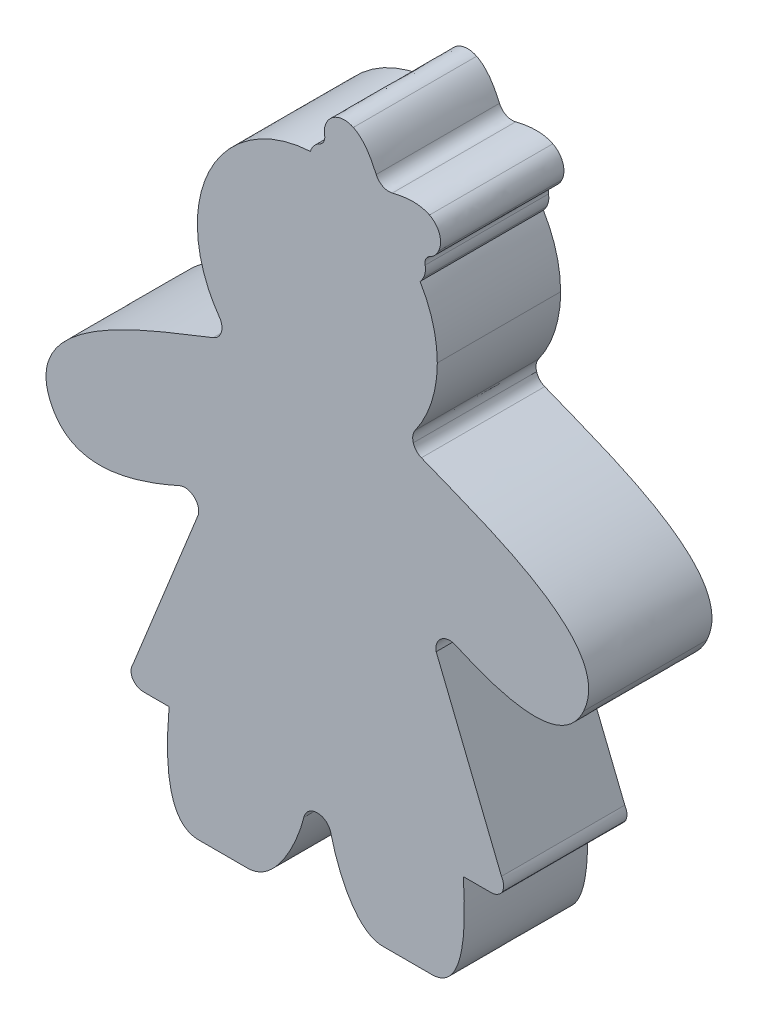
ISO-10303-21;
HEADER;
FILE_DESCRIPTION(('STEP AP214'),'2;1');
FILE_NAME('part.step','',(''),(''),'','','');
FILE_SCHEMA(('AUTOMOTIVE_DESIGN { 1 0 10303 214 1 1 1 1 }'));
ENDSEC;
DATA;
#1=APPLICATION_CONTEXT('core data for automotive mechanical design processes');
#2=APPLICATION_PROTOCOL_DEFINITION('international standard','automotive_design',2000,#1);
#3=PRODUCT_CONTEXT('',#1,'mechanical');
#4=PRODUCT('Part','Part','',(#3));
#5=PRODUCT_RELATED_PRODUCT_CATEGORY('part','',(#4));
#6=PRODUCT_DEFINITION_FORMATION('','',#4);
#7=PRODUCT_DEFINITION_CONTEXT('part definition',#1,'design');
#8=PRODUCT_DEFINITION('design','',#6,#7);
#9=PRODUCT_DEFINITION_SHAPE('','',#8);
#10=(LENGTH_UNIT() NAMED_UNIT(*) SI_UNIT(.MILLI.,.METRE.));
#11=(NAMED_UNIT(*) PLANE_ANGLE_UNIT() SI_UNIT($,.RADIAN.));
#12=(NAMED_UNIT(*) SI_UNIT($,.STERADIAN.) SOLID_ANGLE_UNIT());
#13=UNCERTAINTY_MEASURE_WITH_UNIT(LENGTH_MEASURE(1.E-05),#10,'distance_accuracy_value','');
#14=(GEOMETRIC_REPRESENTATION_CONTEXT(3) GLOBAL_UNCERTAINTY_ASSIGNED_CONTEXT((#13)) GLOBAL_UNIT_ASSIGNED_CONTEXT((#10,
#11,#12)) REPRESENTATION_CONTEXT('',''));
#15=CARTESIAN_POINT('',(0.,0.,0.));
#16=DIRECTION('',(0.,0.,1.));
#17=DIRECTION('',(1.,0.,0.));
#18=AXIS2_PLACEMENT_3D('',#15,#16,#17);
#19=CARTESIAN_POINT('',(422.058820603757,280.028039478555,8.));
#20=CARTESIAN_POINT('',(421.79584058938,280.135229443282,8.));
#21=CARTESIAN_POINT('',(421.614040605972,280.336829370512,8.));
#22=CARTESIAN_POINT('',(421.534480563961,280.609439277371,8.));
#23=B_SPLINE_CURVE_WITH_KNOTS('',3,(#19,#20,#21,#22),.UNSPECIFIED.,.F.,.F.,(4,4),
(0.958333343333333,1.),.UNSPECIFIED.);
#24=DIRECTION('',(0.,0.,-1.));
#25=VECTOR('',#24,1.);
#26=SURFACE_OF_LINEAR_EXTRUSION('',#23,#25);
#27=CARTESIAN_POINT('',(422.058820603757,280.028039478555,0.));
#28=CARTESIAN_POINT('',(421.79584058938,280.135229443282,0.));
#29=CARTESIAN_POINT('',(421.614040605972,280.336829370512,0.));
#30=CARTESIAN_POINT('',(421.534480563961,280.609439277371,0.));
#31=B_SPLINE_CURVE_WITH_KNOTS('',3,(#27,#28,#29,#30),.UNSPECIFIED.,.F.,.F.,(4,4),
(0.958333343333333,1.),.UNSPECIFIED.);
#32=CARTESIAN_POINT('',(422.058820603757,280.028039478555,0.));
#33=VERTEX_POINT('',#32);
#34=CARTESIAN_POINT('',(421.534480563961,280.609439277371,0.));
#35=VERTEX_POINT('',#34);
#36=EDGE_CURVE('E599',#33,#35,#31,.T.);
#37=ORIENTED_EDGE('',*,*,#36,.T.);
#38=DIRECTION('',(0.,0.,-1.));
#39=VECTOR('',#38,1.);
#40=CARTESIAN_POINT('',(421.534480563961,280.609439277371,8.));
#41=LINE('',#40,#39);
#42=CARTESIAN_POINT('',(421.534480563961,280.609439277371,8.));
#43=VERTEX_POINT('',#42);
#44=EDGE_CURVE('E11',#43,#35,#41,.T.);
#45=ORIENTED_EDGE('',*,*,#44,.F.);
#46=CARTESIAN_POINT('',(422.058820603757,280.028039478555,8.));
#47=VERTEX_POINT('',#46);
#48=EDGE_CURVE('E890',#47,#43,#23,.T.);
#49=ORIENTED_EDGE('',*,*,#48,.F.);
#50=DIRECTION('',(0.,0.,-1.));
#51=VECTOR('',#50,1.);
#52=CARTESIAN_POINT('',(422.058820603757,280.028039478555,8.));
#53=LINE('',#52,#51);
#54=EDGE_CURVE('E351',#47,#33,#53,.T.);
#55=ORIENTED_EDGE('',*,*,#54,.T.);
#56=EDGE_LOOP('',(#37,#45,#49,#55));
#57=FACE_BOUND('',#56,.T.);
#58=ADVANCED_FACE('F36',(#57),#26,.F.);
#59=CARTESIAN_POINT('',(421.534480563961,280.609439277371,8.));
#60=CARTESIAN_POINT('',(421.454920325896,280.882139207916,8.));
#61=CARTESIAN_POINT('',(421.499830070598,281.149889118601,8.));
#62=CARTESIAN_POINT('',(421.663989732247,281.381639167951,8.));
#63=B_SPLINE_CURVE_WITH_KNOTS('',3,(#59,#60,#61,#62),.UNSPECIFIED.,.F.,.F.,(4,4),(0.93750001,
0.958333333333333),.UNSPECIFIED.);
#64=DIRECTION('',(0.,0.,-1.));
#65=VECTOR('',#64,1.);
#66=SURFACE_OF_LINEAR_EXTRUSION('',#63,#65);
#67=CARTESIAN_POINT('',(421.534480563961,280.609439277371,0.));
#68=CARTESIAN_POINT('',(421.454920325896,280.882139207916,0.));
#69=CARTESIAN_POINT('',(421.499830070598,281.149889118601,0.));
#70=CARTESIAN_POINT('',(421.663989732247,281.381639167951,0.));
#71=B_SPLINE_CURVE_WITH_KNOTS('',3,(#67,#68,#69,#70),.UNSPECIFIED.,.F.,.F.,(4,4),(0.93750001,
0.958333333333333),.UNSPECIFIED.);
#72=CARTESIAN_POINT('',(421.663989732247,281.381639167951,0.));
#73=VERTEX_POINT('',#72);
#74=EDGE_CURVE('E593',#35,#73,#71,.T.);
#75=ORIENTED_EDGE('',*,*,#74,.T.);
#76=DIRECTION('',(0.,0.,-1.));
#77=VECTOR('',#76,1.);
#78=CARTESIAN_POINT('',(421.663989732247,281.381639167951,8.));
#79=LINE('',#78,#77);
#80=CARTESIAN_POINT('',(421.663989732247,281.381639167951,8.));
#81=VERTEX_POINT('',#80);
#82=EDGE_CURVE('E45',#81,#73,#79,.T.);
#83=ORIENTED_EDGE('',*,*,#82,.F.);
#84=EDGE_CURVE('E207',#43,#81,#63,.T.);
#85=ORIENTED_EDGE('',*,*,#84,.F.);
#86=ORIENTED_EDGE('',*,*,#44,.T.);
#87=EDGE_LOOP('',(#75,#83,#85,#86));
#88=FACE_BOUND('',#87,.T.);
#89=ADVANCED_FACE('F921',(#88),#66,.F.);
#90=CARTESIAN_POINT('',(421.663989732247,281.381639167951,8.));
#91=CARTESIAN_POINT('',(422.562639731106,282.65063916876,8.));
#92=CARTESIAN_POINT('',(423.090849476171,284.200708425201,8.));
#93=CARTESIAN_POINT('',(423.090849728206,285.873987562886,8.));
#94=B_SPLINE_CURVE_WITH_KNOTS('',3,(#90,#91,#92,#93),.UNSPECIFIED.,.F.,.F.,(4,4),
(0.916666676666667,0.9375),.UNSPECIFIED.);
#95=DIRECTION('',(0.,0.,-1.));
#96=VECTOR('',#95,1.);
#97=SURFACE_OF_LINEAR_EXTRUSION('',#94,#96);
#98=CARTESIAN_POINT('',(421.663989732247,281.381639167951,0.));
#99=CARTESIAN_POINT('',(422.562639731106,282.65063916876,0.));
#100=CARTESIAN_POINT('',(423.090849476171,284.200708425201,0.));
#101=CARTESIAN_POINT('',(423.090849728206,285.873987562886,0.));
#102=B_SPLINE_CURVE_WITH_KNOTS('',3,(#98,#99,#100,#101),.UNSPECIFIED.,.F.,.F.,(4,4),
(0.916666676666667,0.9375),.UNSPECIFIED.);
#103=CARTESIAN_POINT('',(423.090849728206,285.873987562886,0.));
#104=VERTEX_POINT('',#103);
#105=EDGE_CURVE('E587',#73,#104,#102,.T.);
#106=ORIENTED_EDGE('',*,*,#105,.T.);
#107=DIRECTION('',(0.,0.,-1.));
#108=VECTOR('',#107,1.);
#109=CARTESIAN_POINT('',(423.090849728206,285.873987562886,8.));
#110=LINE('',#109,#108);
#111=CARTESIAN_POINT('',(423.090849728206,285.873987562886,8.));
#112=VERTEX_POINT('',#111);
#113=EDGE_CURVE('E579',#112,#104,#110,.T.);
#114=ORIENTED_EDGE('',*,*,#113,.F.);
#115=EDGE_CURVE('E588',#81,#112,#94,.T.);
#116=ORIENTED_EDGE('',*,*,#115,.F.);
#117=ORIENTED_EDGE('',*,*,#82,.T.);
#118=EDGE_LOOP('',(#106,#114,#116,#117));
#119=FACE_BOUND('',#118,.T.);
#120=ADVANCED_FACE('F585',(#119),#97,.F.);
#121=CARTESIAN_POINT('',(423.090849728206,285.873987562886,8.));
#122=CARTESIAN_POINT('',(423.0908500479,287.344407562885,8.));
#123=CARTESIAN_POINT('',(422.682880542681,288.719426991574,8.));
#124=CARTESIAN_POINT('',(421.974131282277,289.892396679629,8.));
#125=B_SPLINE_CURVE_WITH_KNOTS('',3,(#121,#122,#123,#124),.UNSPECIFIED.,.F.,.F.,(4,4),
(0.895833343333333,0.916666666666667),.UNSPECIFIED.);
#126=DIRECTION('',(0.,0.,-1.));
#127=VECTOR('',#126,1.);
#128=SURFACE_OF_LINEAR_EXTRUSION('',#125,#127);
#129=CARTESIAN_POINT('',(423.090849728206,285.873987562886,0.));
#130=CARTESIAN_POINT('',(423.0908500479,287.344407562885,0.));
#131=CARTESIAN_POINT('',(422.682880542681,288.719426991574,0.));
#132=CARTESIAN_POINT('',(421.974131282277,289.892396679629,0.));
#133=B_SPLINE_CURVE_WITH_KNOTS('',3,(#129,#130,#131,#132),.UNSPECIFIED.,.F.,.F.,(4,4),
(0.895833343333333,0.916666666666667),.UNSPECIFIED.);
#134=CARTESIAN_POINT('',(421.974131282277,289.892396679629,0.));
#135=VERTEX_POINT('',#134);
#136=EDGE_CURVE('E595',#104,#135,#133,.T.);
#137=ORIENTED_EDGE('',*,*,#136,.T.);
#138=DIRECTION('',(0.,0.,-1.));
#139=VECTOR('',#138,1.);
#140=CARTESIAN_POINT('',(421.974131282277,289.892396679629,8.));
#141=LINE('',#140,#139);
#142=CARTESIAN_POINT('',(421.974131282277,289.892396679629,8.));
#143=VERTEX_POINT('',#142);
#144=EDGE_CURVE('E576',#143,#135,#141,.T.);
#145=ORIENTED_EDGE('',*,*,#144,.F.);
#146=EDGE_CURVE('E933',#112,#143,#125,.T.);
#147=ORIENTED_EDGE('',*,*,#146,.F.);
#148=ORIENTED_EDGE('',*,*,#113,.T.);
#149=EDGE_LOOP('',(#137,#145,#147,#148));
#150=FACE_BOUND('',#149,.T.);
#151=ADVANCED_FACE('F926',(#150),#128,.F.);
#152=CARTESIAN_POINT('',(421.974131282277,289.892396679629,8.));
#153=CARTESIAN_POINT('',(422.054320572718,289.979967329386,8.));
#154=CARTESIAN_POINT('',(422.1236197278,290.080137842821,8.));
#155=CARTESIAN_POINT('',(422.178968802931,290.191828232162,8.));
#156=B_SPLINE_CURVE_WITH_KNOTS('',3,(#152,#153,#154,#155),.UNSPECIFIED.,.F.,.F.,(4,4),
(0.87500001,0.895833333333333),.UNSPECIFIED.);
#157=DIRECTION('',(0.,0.,-1.));
#158=VECTOR('',#157,1.);
#159=SURFACE_OF_LINEAR_EXTRUSION('',#156,#158);
#160=CARTESIAN_POINT('',(421.974131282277,289.892396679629,0.));
#161=CARTESIAN_POINT('',(422.054320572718,289.979967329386,0.));
#162=CARTESIAN_POINT('',(422.1236197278,290.080137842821,0.));
#163=CARTESIAN_POINT('',(422.178968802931,290.191828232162,0.));
#164=B_SPLINE_CURVE_WITH_KNOTS('',3,(#160,#161,#162,#163),.UNSPECIFIED.,.F.,.F.,(4,4),
(0.87500001,0.895833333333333),.UNSPECIFIED.);
#165=CARTESIAN_POINT('',(422.178968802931,290.191828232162,0.));
#166=VERTEX_POINT('',#165);
#167=EDGE_CURVE('E597',#135,#166,#164,.T.);
#168=ORIENTED_EDGE('',*,*,#167,.T.);
#169=DIRECTION('',(0.,0.,-1.));
#170=VECTOR('',#169,1.);
#171=CARTESIAN_POINT('',(422.178968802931,290.191828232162,8.));
#172=LINE('',#171,#170);
#173=CARTESIAN_POINT('',(422.178968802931,290.191828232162,8.));
#174=VERTEX_POINT('',#173);
#175=EDGE_CURVE('E573',#174,#166,#172,.T.);
#176=ORIENTED_EDGE('',*,*,#175,.F.);
#177=EDGE_CURVE('E937',#143,#174,#156,.T.);
#178=ORIENTED_EDGE('',*,*,#177,.F.);
#179=ORIENTED_EDGE('',*,*,#144,.T.);
#180=EDGE_LOOP('',(#168,#176,#178,#179));
#181=FACE_BOUND('',#180,.T.);
#182=ADVANCED_FACE('F929',(#181),#159,.F.);
#183=CARTESIAN_POINT('',(422.178968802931,290.191828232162,8.));
#184=CARTESIAN_POINT('',(422.303169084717,290.442208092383,8.));
#185=CARTESIAN_POINT('',(422.35977934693,290.699337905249,8.));
#186=CARTESIAN_POINT('',(422.304879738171,290.975997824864,8.));
#187=B_SPLINE_CURVE_WITH_KNOTS('',3,(#183,#184,#185,#186),.UNSPECIFIED.,.F.,.F.,(4,4),
(0.854166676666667,0.875),.UNSPECIFIED.);
#188=DIRECTION('',(0.,0.,-1.));
#189=VECTOR('',#188,1.);
#190=SURFACE_OF_LINEAR_EXTRUSION('',#187,#189);
#191=CARTESIAN_POINT('',(422.178968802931,290.191828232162,0.));
#192=CARTESIAN_POINT('',(422.303169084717,290.442208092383,0.));
#193=CARTESIAN_POINT('',(422.35977934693,290.699337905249,0.));
#194=CARTESIAN_POINT('',(422.304879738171,290.975997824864,0.));
#195=B_SPLINE_CURVE_WITH_KNOTS('',3,(#191,#192,#193,#194),.UNSPECIFIED.,.F.,.F.,(4,4),
(0.854166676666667,0.875),.UNSPECIFIED.);
#196=CARTESIAN_POINT('',(422.304879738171,290.975997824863,0.));
#197=VERTEX_POINT('',#196);
#198=EDGE_CURVE('E617',#166,#197,#195,.T.);
#199=ORIENTED_EDGE('',*,*,#198,.T.);
#200=DIRECTION('',(0.,0.,-1.));
#201=VECTOR('',#200,1.);
#202=CARTESIAN_POINT('',(422.304879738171,290.975997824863,8.));
#203=LINE('',#202,#201);
#204=CARTESIAN_POINT('',(422.304879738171,290.975997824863,8.));
#205=VERTEX_POINT('',#204);
#206=EDGE_CURVE('E570',#205,#197,#203,.T.);
#207=ORIENTED_EDGE('',*,*,#206,.F.);
#208=EDGE_CURVE('E945',#174,#205,#187,.T.);
#209=ORIENTED_EDGE('',*,*,#208,.F.);
#210=ORIENTED_EDGE('',*,*,#175,.T.);
#211=EDGE_LOOP('',(#199,#207,#209,#210));
#212=FACE_BOUND('',#211,.T.);
#213=ADVANCED_FACE('F961',(#212),#190,.F.);
#214=CARTESIAN_POINT('',(422.304879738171,290.975997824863,8.));
#215=CARTESIAN_POINT('',(422.252409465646,291.240237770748,8.));
#216=CARTESIAN_POINT('',(422.381109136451,291.499527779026,8.));
#217=CARTESIAN_POINT('',(422.623118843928,291.617788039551,8.));
#218=B_SPLINE_CURVE_WITH_KNOTS('',3,(#214,#215,#216,#217),.UNSPECIFIED.,.F.,.F.,(4,4),
(0.833333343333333,0.854166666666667),.UNSPECIFIED.);
#219=DIRECTION('',(0.,0.,-1.));
#220=VECTOR('',#219,1.);
#221=SURFACE_OF_LINEAR_EXTRUSION('',#218,#220);
#222=CARTESIAN_POINT('',(422.304879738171,290.975997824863,0.));
#223=CARTESIAN_POINT('',(422.252409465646,291.240237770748,0.));
#224=CARTESIAN_POINT('',(422.381109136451,291.499527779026,0.));
#225=CARTESIAN_POINT('',(422.623118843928,291.617788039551,0.));
#226=B_SPLINE_CURVE_WITH_KNOTS('',3,(#222,#223,#224,#225),.UNSPECIFIED.,.F.,.F.,(4,4),
(0.833333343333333,0.854166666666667),.UNSPECIFIED.);
#227=CARTESIAN_POINT('',(422.623118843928,291.617788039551,0.));
#228=VERTEX_POINT('',#227);
#229=EDGE_CURVE('E624',#197,#228,#226,.T.);
#230=ORIENTED_EDGE('',*,*,#229,.T.);
#231=DIRECTION('',(0.,0.,-1.));
#232=VECTOR('',#231,1.);
#233=CARTESIAN_POINT('',(422.623118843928,291.617788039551,8.));
#234=LINE('',#233,#232);
#235=CARTESIAN_POINT('',(422.623118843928,291.617788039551,8.));
#236=VERTEX_POINT('',#235);
#237=EDGE_CURVE('E567',#236,#228,#234,.T.);
#238=ORIENTED_EDGE('',*,*,#237,.F.);
#239=EDGE_CURVE('E953',#205,#236,#218,.T.);
#240=ORIENTED_EDGE('',*,*,#239,.F.);
#241=ORIENTED_EDGE('',*,*,#206,.T.);
#242=EDGE_LOOP('',(#230,#238,#240,#241));
#243=FACE_BOUND('',#242,.T.);
#244=ADVANCED_FACE('F964',(#243),#221,.F.);
#245=CARTESIAN_POINT('',(422.623118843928,291.617788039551,8.));
#246=CARTESIAN_POINT('',(422.876738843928,291.741718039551,8.));
#247=CARTESIAN_POINT('',(423.04683876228,291.942147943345,8.));
#248=CARTESIAN_POINT('',(423.17112872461,292.192797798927,8.));
#249=B_SPLINE_CURVE_WITH_KNOTS('',3,(#245,#246,#247,#248),.UNSPECIFIED.,.F.,.F.,(4,4),
(0.81250001,0.833333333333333),.UNSPECIFIED.);
#250=DIRECTION('',(0.,0.,-1.));
#251=VECTOR('',#250,1.);
#252=SURFACE_OF_LINEAR_EXTRUSION('',#249,#251);
#253=CARTESIAN_POINT('',(422.623118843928,291.617788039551,0.));
#254=CARTESIAN_POINT('',(422.876738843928,291.741718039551,0.));
#255=CARTESIAN_POINT('',(423.04683876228,291.942147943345,0.));
#256=CARTESIAN_POINT('',(423.17112872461,292.192797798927,0.));
#257=B_SPLINE_CURVE_WITH_KNOTS('',3,(#253,#254,#255,#256),.UNSPECIFIED.,.F.,.F.,(4,4),
(0.81250001,0.833333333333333),.UNSPECIFIED.);
#258=CARTESIAN_POINT('',(423.17112872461,292.192797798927,0.));
#259=VERTEX_POINT('',#258);
#260=EDGE_CURVE('E631',#228,#259,#257,.T.);
#261=ORIENTED_EDGE('',*,*,#260,.T.);
#262=DIRECTION('',(0.,0.,-1.));
#263=VECTOR('',#262,1.);
#264=CARTESIAN_POINT('',(423.17112872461,292.192797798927,8.));
#265=LINE('',#264,#263);
#266=CARTESIAN_POINT('',(423.17112872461,292.192797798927,8.));
#267=VERTEX_POINT('',#266);
#268=EDGE_CURVE('E564',#267,#259,#265,.T.);
#269=ORIENTED_EDGE('',*,*,#268,.F.);
#270=EDGE_CURVE('E976',#236,#267,#249,.T.);
#271=ORIENTED_EDGE('',*,*,#270,.F.);
#272=ORIENTED_EDGE('',*,*,#237,.T.);
#273=EDGE_LOOP('',(#261,#269,#271,#272));
#274=FACE_BOUND('',#273,.T.);
#275=ADVANCED_FACE('F968',(#274),#252,.F.);
#276=CARTESIAN_POINT('',(423.17112872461,292.192797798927,8.));
#277=CARTESIAN_POINT('',(423.48909872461,292.834047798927,8.));
#278=CARTESIAN_POINT('',(423.226568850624,293.612727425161,8.));
#279=CARTESIAN_POINT('',(422.585229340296,293.930697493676,8.));
#280=B_SPLINE_CURVE_WITH_KNOTS('',3,(#276,#277,#278,#279),.UNSPECIFIED.,.F.,.F.,(4,4),
(0.791666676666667,0.8125),.UNSPECIFIED.);
#281=DIRECTION('',(0.,0.,-1.));
#282=VECTOR('',#281,1.);
#283=SURFACE_OF_LINEAR_EXTRUSION('',#280,#282);
#284=CARTESIAN_POINT('',(423.17112872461,292.192797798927,0.));
#285=CARTESIAN_POINT('',(423.48909872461,292.834047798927,0.));
#286=CARTESIAN_POINT('',(423.226568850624,293.612727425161,0.));
#287=CARTESIAN_POINT('',(422.585229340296,293.930697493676,0.));
#288=B_SPLINE_CURVE_WITH_KNOTS('',3,(#284,#285,#286,#287),.UNSPECIFIED.,.F.,.F.,(4,4),
(0.791666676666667,0.8125),.UNSPECIFIED.);
#289=CARTESIAN_POINT('',(422.585229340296,293.930697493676,0.));
#290=VERTEX_POINT('',#289);
#291=EDGE_CURVE('E638',#259,#290,#288,.T.);
#292=ORIENTED_EDGE('',*,*,#291,.T.);
#293=DIRECTION('',(0.,0.,-1.));
#294=VECTOR('',#293,1.);
#295=CARTESIAN_POINT('',(422.585229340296,293.930697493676,8.));
#296=LINE('',#295,#294);
#297=CARTESIAN_POINT('',(422.585229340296,293.930697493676,8.));
#298=VERTEX_POINT('',#297);
#299=EDGE_CURVE('E561',#298,#290,#296,.T.);
#300=ORIENTED_EDGE('',*,*,#299,.F.);
#301=EDGE_CURVE('E980',#267,#298,#280,.T.);
#302=ORIENTED_EDGE('',*,*,#301,.F.);
#303=ORIENTED_EDGE('',*,*,#268,.T.);
#304=EDGE_LOOP('',(#292,#300,#302,#303));
#305=FACE_BOUND('',#304,.T.);
#306=ADVANCED_FACE('F972',(#305),#283,.F.);
#307=CARTESIAN_POINT('',(422.585229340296,293.930697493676,8.));
#308=CARTESIAN_POINT('',(421.893219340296,294.273777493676,8.));
#309=CARTESIAN_POINT('',(420.987999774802,294.163797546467,8.));
#310=CARTESIAN_POINT('',(420.173410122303,293.960037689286,8.));
#311=B_SPLINE_CURVE_WITH_KNOTS('',3,(#307,#308,#309,#310),.UNSPECIFIED.,.F.,.F.,(4,4),
(0.770833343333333,0.791666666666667),.UNSPECIFIED.);
#312=DIRECTION('',(0.,0.,-1.));
#313=VECTOR('',#312,1.);
#314=SURFACE_OF_LINEAR_EXTRUSION('',#311,#313);
#315=CARTESIAN_POINT('',(422.585229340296,293.930697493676,0.));
#316=CARTESIAN_POINT('',(421.893219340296,294.273777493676,0.));
#317=CARTESIAN_POINT('',(420.987999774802,294.163797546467,0.));
#318=CARTESIAN_POINT('',(420.173410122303,293.960037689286,0.));
#319=B_SPLINE_CURVE_WITH_KNOTS('',3,(#315,#316,#317,#318),.UNSPECIFIED.,.F.,.F.,(4,4),
(0.770833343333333,0.791666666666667),.UNSPECIFIED.);
#320=CARTESIAN_POINT('',(420.173410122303,293.960037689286,0.));
#321=VERTEX_POINT('',#320);
#322=EDGE_CURVE('E645',#290,#321,#319,.T.);
#323=ORIENTED_EDGE('',*,*,#322,.T.);
#324=DIRECTION('',(0.,0.,-1.));
#325=VECTOR('',#324,1.);
#326=CARTESIAN_POINT('',(420.173410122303,293.960037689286,8.));
#327=LINE('',#326,#325);
#328=CARTESIAN_POINT('',(420.173410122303,293.960037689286,8.));
#329=VERTEX_POINT('',#328);
#330=EDGE_CURVE('E558',#329,#321,#327,.T.);
#331=ORIENTED_EDGE('',*,*,#330,.F.);
#332=EDGE_CURVE('E988',#298,#329,#311,.T.);
#333=ORIENTED_EDGE('',*,*,#332,.F.);
#334=ORIENTED_EDGE('',*,*,#299,.T.);
#335=EDGE_LOOP('',(#323,#331,#333,#334));
#336=FACE_BOUND('',#335,.T.);
#337=ADVANCED_FACE('F1004',(#336),#314,.F.);
#338=CARTESIAN_POINT('',(420.173410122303,293.960037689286,8.));
#339=CARTESIAN_POINT('',(419.741500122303,293.852037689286,8.));
#340=CARTESIAN_POINT('',(419.3033803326,294.069297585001,8.));
#341=CARTESIAN_POINT('',(419.127880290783,294.478437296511,8.));
#342=B_SPLINE_CURVE_WITH_KNOTS('',3,(#338,#339,#340,#341),.UNSPECIFIED.,.F.,.F.,(4,4),
(0.75000001,0.770833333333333),.UNSPECIFIED.);
#343=DIRECTION('',(0.,0.,-1.));
#344=VECTOR('',#343,1.);
#345=SURFACE_OF_LINEAR_EXTRUSION('',#342,#344);
#346=CARTESIAN_POINT('',(420.173410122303,293.960037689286,0.));
#347=CARTESIAN_POINT('',(419.741500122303,293.852037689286,0.));
#348=CARTESIAN_POINT('',(419.3033803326,294.069297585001,0.));
#349=CARTESIAN_POINT('',(419.127880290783,294.478437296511,0.));
#350=B_SPLINE_CURVE_WITH_KNOTS('',3,(#346,#347,#348,#349),.UNSPECIFIED.,.F.,.F.,(4,4),
(0.75000001,0.770833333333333),.UNSPECIFIED.);
#351=CARTESIAN_POINT('',(419.127880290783,294.478437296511,0.));
#352=VERTEX_POINT('',#351);
#353=EDGE_CURVE('E652',#321,#352,#350,.T.);
#354=ORIENTED_EDGE('',*,*,#353,.T.);
#355=DIRECTION('',(0.,0.,-1.));
#356=VECTOR('',#355,1.);
#357=CARTESIAN_POINT('',(419.127880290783,294.478437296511,8.));
#358=LINE('',#357,#356);
#359=CARTESIAN_POINT('',(419.127880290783,294.478437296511,8.));
#360=VERTEX_POINT('',#359);
#361=EDGE_CURVE('E555',#360,#352,#358,.T.);
#362=ORIENTED_EDGE('',*,*,#361,.F.);
#363=EDGE_CURVE('E996',#329,#360,#342,.T.);
#364=ORIENTED_EDGE('',*,*,#363,.F.);
#365=ORIENTED_EDGE('',*,*,#330,.T.);
#366=EDGE_LOOP('',(#354,#362,#364,#365));
#367=FACE_BOUND('',#366,.T.);
#368=ADVANCED_FACE('F1007',(#367),#345,.F.);
#369=CARTESIAN_POINT('',(419.127880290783,294.478437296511,8.));
#370=CARTESIAN_POINT('',(418.797040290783,295.250097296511,8.));
#371=CARTESIAN_POINT('',(418.336600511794,296.037146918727,8.));
#372=CARTESIAN_POINT('',(417.644590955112,296.380316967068,8.));
#373=B_SPLINE_CURVE_WITH_KNOTS('',3,(#369,#370,#371,#372),.UNSPECIFIED.,.F.,.F.,(4,4),
(0.729166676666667,0.75),.UNSPECIFIED.);
#374=DIRECTION('',(0.,0.,-1.));
#375=VECTOR('',#374,1.);
#376=SURFACE_OF_LINEAR_EXTRUSION('',#373,#375);
#377=CARTESIAN_POINT('',(419.127880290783,294.478437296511,0.));
#378=CARTESIAN_POINT('',(418.797040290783,295.250097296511,0.));
#379=CARTESIAN_POINT('',(418.336600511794,296.037146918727,0.));
#380=CARTESIAN_POINT('',(417.644590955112,296.380316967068,0.));
#381=B_SPLINE_CURVE_WITH_KNOTS('',3,(#377,#378,#379,#380),.UNSPECIFIED.,.F.,.F.,(4,4),
(0.729166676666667,0.75),.UNSPECIFIED.);
#382=CARTESIAN_POINT('',(417.644590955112,296.380316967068,0.));
#383=VERTEX_POINT('',#382);
#384=EDGE_CURVE('E659',#352,#383,#381,.T.);
#385=ORIENTED_EDGE('',*,*,#384,.T.);
#386=DIRECTION('',(0.,0.,-1.));
#387=VECTOR('',#386,1.);
#388=CARTESIAN_POINT('',(417.644590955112,296.380316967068,8.));
#389=LINE('',#388,#387);
#390=CARTESIAN_POINT('',(417.644590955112,296.380316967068,8.));
#391=VERTEX_POINT('',#390);
#392=EDGE_CURVE('E552',#391,#383,#389,.T.);
#393=ORIENTED_EDGE('',*,*,#392,.F.);
#394=EDGE_CURVE('E1019',#360,#391,#373,.T.);
#395=ORIENTED_EDGE('',*,*,#394,.F.);
#396=ORIENTED_EDGE('',*,*,#361,.T.);
#397=EDGE_LOOP('',(#385,#393,#395,#396));
#398=FACE_BOUND('',#397,.T.);
#399=ADVANCED_FACE('F1011',(#398),#376,.F.);
#400=CARTESIAN_POINT('',(417.644590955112,296.380316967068,8.));
#401=CARTESIAN_POINT('',(417.003340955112,296.698286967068,8.));
#402=CARTESIAN_POINT('',(416.224661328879,296.435847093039,8.));
#403=CARTESIAN_POINT('',(415.906691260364,295.794507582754,8.));
#404=B_SPLINE_CURVE_WITH_KNOTS('',3,(#400,#401,#402,#403),.UNSPECIFIED.,.F.,.F.,(4,4),
(0.708333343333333,0.729166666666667),.UNSPECIFIED.);
#405=DIRECTION('',(0.,0.,-1.));
#406=VECTOR('',#405,1.);
#407=SURFACE_OF_LINEAR_EXTRUSION('',#404,#406);
#408=CARTESIAN_POINT('',(417.644590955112,296.380316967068,0.));
#409=CARTESIAN_POINT('',(417.003340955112,296.698286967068,0.));
#410=CARTESIAN_POINT('',(416.224661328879,296.435847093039,0.));
#411=CARTESIAN_POINT('',(415.906691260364,295.794507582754,0.));
#412=B_SPLINE_CURVE_WITH_KNOTS('',3,(#408,#409,#410,#411),.UNSPECIFIED.,.F.,.F.,(4,4),
(0.708333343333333,0.729166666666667),.UNSPECIFIED.);
#413=CARTESIAN_POINT('',(415.906691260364,295.794507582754,0.));
#414=VERTEX_POINT('',#413);
#415=EDGE_CURVE('E666',#383,#414,#412,.T.);
#416=ORIENTED_EDGE('',*,*,#415,.T.);
#417=DIRECTION('',(0.,0.,-1.));
#418=VECTOR('',#417,1.);
#419=CARTESIAN_POINT('',(415.906691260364,295.794507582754,8.));
#420=LINE('',#419,#418);
#421=CARTESIAN_POINT('',(415.906691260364,295.794507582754,8.));
#422=VERTEX_POINT('',#421);
#423=EDGE_CURVE('E549',#422,#414,#420,.T.);
#424=ORIENTED_EDGE('',*,*,#423,.F.);
#425=EDGE_CURVE('E1023',#391,#422,#404,.T.);
#426=ORIENTED_EDGE('',*,*,#425,.F.);
#427=ORIENTED_EDGE('',*,*,#392,.T.);
#428=EDGE_LOOP('',(#416,#424,#426,#427));
#429=FACE_BOUND('',#428,.T.);
#430=ADVANCED_FACE('F1015',(#429),#407,.F.);
#431=CARTESIAN_POINT('',(415.906691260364,295.794507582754,8.));
#432=CARTESIAN_POINT('',(415.782491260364,295.544127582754,8.));
#433=CARTESIAN_POINT('',(415.725881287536,295.286997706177,8.));
#434=CARTESIAN_POINT('',(415.78078120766,295.010337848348,8.));
#435=B_SPLINE_CURVE_WITH_KNOTS('',3,(#431,#432,#433,#434),.UNSPECIFIED.,.F.,.F.,(4,4),
(0.68750001,0.708333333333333),.UNSPECIFIED.);
#436=DIRECTION('',(0.,0.,-1.));
#437=VECTOR('',#436,1.);
#438=SURFACE_OF_LINEAR_EXTRUSION('',#435,#437);
#439=CARTESIAN_POINT('',(415.906691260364,295.794507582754,0.));
#440=CARTESIAN_POINT('',(415.782491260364,295.544127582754,0.));
#441=CARTESIAN_POINT('',(415.725881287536,295.286997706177,0.));
#442=CARTESIAN_POINT('',(415.78078120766,295.010337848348,0.));
#443=B_SPLINE_CURVE_WITH_KNOTS('',3,(#439,#440,#441,#442),.UNSPECIFIED.,.F.,.F.,(4,4),
(0.68750001,0.708333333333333),.UNSPECIFIED.);
#444=CARTESIAN_POINT('',(415.78078120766,295.010337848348,0.));
#445=VERTEX_POINT('',#444);
#446=EDGE_CURVE('E673',#414,#445,#443,.T.);
#447=ORIENTED_EDGE('',*,*,#446,.T.);
#448=DIRECTION('',(0.,0.,-1.));
#449=VECTOR('',#448,1.);
#450=CARTESIAN_POINT('',(415.78078120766,295.010337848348,8.));
#451=LINE('',#450,#449);
#452=CARTESIAN_POINT('',(415.78078120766,295.010337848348,8.));
#453=VERTEX_POINT('',#452);
#454=EDGE_CURVE('E546',#453,#445,#451,.T.);
#455=ORIENTED_EDGE('',*,*,#454,.F.);
#456=EDGE_CURVE('E1031',#422,#453,#435,.T.);
#457=ORIENTED_EDGE('',*,*,#456,.F.);
#458=ORIENTED_EDGE('',*,*,#423,.T.);
#459=EDGE_LOOP('',(#447,#455,#457,#458));
#460=FACE_BOUND('',#459,.T.);
#461=ADVANCED_FACE('F1047',(#460),#438,.F.);
#462=CARTESIAN_POINT('',(415.78078120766,295.010337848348,8.));
#463=CARTESIAN_POINT('',(415.83325120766,294.746097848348,8.));
#464=CARTESIAN_POINT('',(415.704551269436,294.486807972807,8.));
#465=CARTESIAN_POINT('',(415.462541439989,294.368547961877,8.));
#466=B_SPLINE_CURVE_WITH_KNOTS('',3,(#462,#463,#464,#465),.UNSPECIFIED.,.F.,.F.,(4,4),
(0.666666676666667,0.6875),.UNSPECIFIED.);
#467=DIRECTION('',(0.,0.,-1.));
#468=VECTOR('',#467,1.);
#469=SURFACE_OF_LINEAR_EXTRUSION('',#466,#468);
#470=CARTESIAN_POINT('',(415.78078120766,295.010337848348,0.));
#471=CARTESIAN_POINT('',(415.83325120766,294.746097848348,0.));
#472=CARTESIAN_POINT('',(415.704551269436,294.486807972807,0.));
#473=CARTESIAN_POINT('',(415.462541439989,294.368547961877,0.));
#474=B_SPLINE_CURVE_WITH_KNOTS('',3,(#470,#471,#472,#473),.UNSPECIFIED.,.F.,.F.,(4,4),
(0.666666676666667,0.6875),.UNSPECIFIED.);
#475=CARTESIAN_POINT('',(415.462541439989,294.368547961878,0.));
#476=VERTEX_POINT('',#475);
#477=EDGE_CURVE('E680',#445,#476,#474,.T.);
#478=ORIENTED_EDGE('',*,*,#477,.T.);
#479=DIRECTION('',(0.,0.,-1.));
#480=VECTOR('',#479,1.);
#481=CARTESIAN_POINT('',(415.462541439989,294.368547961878,8.));
#482=LINE('',#481,#480);
#483=CARTESIAN_POINT('',(415.462541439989,294.368547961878,8.));
#484=VERTEX_POINT('',#483);
#485=EDGE_CURVE('E543',#484,#476,#482,.T.);
#486=ORIENTED_EDGE('',*,*,#485,.F.);
#487=EDGE_CURVE('E1039',#453,#484,#466,.T.);
#488=ORIENTED_EDGE('',*,*,#487,.F.);
#489=ORIENTED_EDGE('',*,*,#454,.T.);
#490=EDGE_LOOP('',(#478,#486,#488,#489));
#491=FACE_BOUND('',#490,.T.);
#492=ADVANCED_FACE('F1050',(#491),#469,.F.);
#493=CARTESIAN_POINT('',(415.462541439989,294.368547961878,8.));
#494=CARTESIAN_POINT('',(415.208921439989,294.244617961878,8.));
#495=CARTESIAN_POINT('',(415.038821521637,294.044188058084,8.));
#496=CARTESIAN_POINT('',(414.914531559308,293.793538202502,8.));
#497=B_SPLINE_CURVE_WITH_KNOTS('',3,(#493,#494,#495,#496),.UNSPECIFIED.,.F.,.F.,(4,4),
(0.645833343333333,0.666666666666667),.UNSPECIFIED.);
#498=DIRECTION('',(0.,0.,-1.));
#499=VECTOR('',#498,1.);
#500=SURFACE_OF_LINEAR_EXTRUSION('',#497,#499);
#501=CARTESIAN_POINT('',(415.462541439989,294.368547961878,0.));
#502=CARTESIAN_POINT('',(415.208921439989,294.244617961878,0.));
#503=CARTESIAN_POINT('',(415.038821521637,294.044188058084,0.));
#504=CARTESIAN_POINT('',(414.914531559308,293.793538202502,0.));
#505=B_SPLINE_CURVE_WITH_KNOTS('',3,(#501,#502,#503,#504),.UNSPECIFIED.,.F.,.F.,(4,4),
(0.645833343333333,0.666666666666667),.UNSPECIFIED.);
#506=CARTESIAN_POINT('',(414.914531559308,293.793538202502,0.));
#507=VERTEX_POINT('',#506);
#508=EDGE_CURVE('E687',#476,#507,#505,.T.);
#509=ORIENTED_EDGE('',*,*,#508,.T.);
#510=DIRECTION('',(0.,0.,-1.));
#511=VECTOR('',#510,1.);
#512=CARTESIAN_POINT('',(414.914531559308,293.793538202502,8.));
#513=LINE('',#512,#511);
#514=CARTESIAN_POINT('',(414.914531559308,293.793538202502,8.));
#515=VERTEX_POINT('',#514);
#516=EDGE_CURVE('E540',#515,#507,#513,.T.);
#517=ORIENTED_EDGE('',*,*,#516,.F.);
#518=EDGE_CURVE('E1062',#484,#515,#497,.T.);
#519=ORIENTED_EDGE('',*,*,#518,.F.);
#520=ORIENTED_EDGE('',*,*,#485,.T.);
#521=EDGE_LOOP('',(#509,#517,#519,#520));
#522=FACE_BOUND('',#521,.T.);
#523=ADVANCED_FACE('F1054',(#522),#500,.F.);
#524=CARTESIAN_POINT('',(414.914531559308,293.793538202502,8.));
#525=CARTESIAN_POINT('',(414.889871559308,293.743768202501,8.));
#526=CARTESIAN_POINT('',(414.86872156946,293.69318822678,8.));
#527=CARTESIAN_POINT('',(414.850901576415,293.642068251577,8.));
#528=B_SPLINE_CURVE_WITH_KNOTS('',3,(#524,#525,#526,#527),.UNSPECIFIED.,.F.,.F.,(4,4),
(0.62500001,0.645833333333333),.UNSPECIFIED.);
#529=DIRECTION('',(0.,0.,-1.));
#530=VECTOR('',#529,1.);
#531=SURFACE_OF_LINEAR_EXTRUSION('',#528,#530);
#532=CARTESIAN_POINT('',(414.914531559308,293.793538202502,0.));
#533=CARTESIAN_POINT('',(414.889871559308,293.743768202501,0.));
#534=CARTESIAN_POINT('',(414.86872156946,293.69318822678,0.));
#535=CARTESIAN_POINT('',(414.850901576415,293.642068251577,0.));
#536=B_SPLINE_CURVE_WITH_KNOTS('',3,(#532,#533,#534,#535),.UNSPECIFIED.,.F.,.F.,(4,4),
(0.62500001,0.645833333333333),.UNSPECIFIED.);
#537=CARTESIAN_POINT('',(414.850901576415,293.642068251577,0.));
#538=VERTEX_POINT('',#537);
#539=EDGE_CURVE('E694',#507,#538,#536,.T.);
#540=ORIENTED_EDGE('',*,*,#539,.T.);
#541=DIRECTION('',(0.,0.,-1.));
#542=VECTOR('',#541,1.);
#543=CARTESIAN_POINT('',(414.850901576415,293.642068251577,8.));
#544=LINE('',#543,#542);
#545=CARTESIAN_POINT('',(414.850901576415,293.642068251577,8.));
#546=VERTEX_POINT('',#545);
#547=EDGE_CURVE('E537',#546,#538,#544,.T.);
#548=ORIENTED_EDGE('',*,*,#547,.F.);
#549=EDGE_CURVE('E1066',#515,#546,#528,.T.);
#550=ORIENTED_EDGE('',*,*,#549,.F.);
#551=ORIENTED_EDGE('',*,*,#516,.T.);
#552=EDGE_LOOP('',(#540,#548,#550,#551));
#553=FACE_BOUND('',#552,.T.);
#554=ADVANCED_FACE('F1058',(#553),#531,.F.);
#555=CARTESIAN_POINT('',(414.850901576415,293.642068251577,8.));
#556=CARTESIAN_POINT('',(410.766431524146,293.404829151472,8.));
#557=CARTESIAN_POINT('',(407.5271523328,290.017951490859,8.));
#558=CARTESIAN_POINT('',(407.527149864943,285.873993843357,8.));
#559=B_SPLINE_CURVE_WITH_KNOTS('',3,(#555,#556,#557,#558),.UNSPECIFIED.,.F.,.F.,(4,4),
(0.604166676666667,0.625),.UNSPECIFIED.);
#560=DIRECTION('',(0.,0.,-1.));
#561=VECTOR('',#560,1.);
#562=SURFACE_OF_LINEAR_EXTRUSION('',#559,#561);
#563=CARTESIAN_POINT('',(414.850901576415,293.642068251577,0.));
#564=CARTESIAN_POINT('',(410.766431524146,293.404829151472,0.));
#565=CARTESIAN_POINT('',(407.5271523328,290.017951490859,0.));
#566=CARTESIAN_POINT('',(407.527149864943,285.873993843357,0.));
#567=B_SPLINE_CURVE_WITH_KNOTS('',3,(#563,#564,#565,#566),.UNSPECIFIED.,.F.,.F.,(4,4),
(0.604166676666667,0.625),.UNSPECIFIED.);
#568=CARTESIAN_POINT('',(407.527149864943,285.873993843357,0.));
#569=VERTEX_POINT('',#568);
#570=EDGE_CURVE('E701',#538,#569,#567,.T.);
#571=ORIENTED_EDGE('',*,*,#570,.T.);
#572=DIRECTION('',(0.,0.,-1.));
#573=VECTOR('',#572,1.);
#574=CARTESIAN_POINT('',(407.527149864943,285.873993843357,8.));
#575=LINE('',#574,#573);
#576=CARTESIAN_POINT('',(407.527149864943,285.873993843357,8.));
#577=VERTEX_POINT('',#576);
#578=EDGE_CURVE('E534',#577,#569,#575,.T.);
#579=ORIENTED_EDGE('',*,*,#578,.F.);
#580=EDGE_CURVE('E1074',#546,#577,#559,.T.);
#581=ORIENTED_EDGE('',*,*,#580,.F.);
#582=ORIENTED_EDGE('',*,*,#547,.T.);
#583=EDGE_LOOP('',(#571,#579,#581,#582));
#584=FACE_BOUND('',#583,.T.);
#585=ADVANCED_FACE('F1090',(#584),#562,.F.);
#586=CARTESIAN_POINT('',(407.527149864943,285.873993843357,8.));
#587=CARTESIAN_POINT('',(407.527149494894,284.200623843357,8.));
#588=CARTESIAN_POINT('',(408.055358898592,282.650644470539,8.));
#589=CARTESIAN_POINT('',(408.954098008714,281.381644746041,8.));
#590=B_SPLINE_CURVE_WITH_KNOTS('',3,(#586,#587,#588,#589),.UNSPECIFIED.,.F.,.F.,(4,4),
(0.583333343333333,0.604166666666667),.UNSPECIFIED.);
#591=DIRECTION('',(0.,0.,-1.));
#592=VECTOR('',#591,1.);
#593=SURFACE_OF_LINEAR_EXTRUSION('',#590,#592);
#594=CARTESIAN_POINT('',(407.527149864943,285.873993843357,0.));
#595=CARTESIAN_POINT('',(407.527149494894,284.200623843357,0.));
#596=CARTESIAN_POINT('',(408.055358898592,282.650644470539,0.));
#597=CARTESIAN_POINT('',(408.954098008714,281.381644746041,0.));
#598=B_SPLINE_CURVE_WITH_KNOTS('',3,(#594,#595,#596,#597),.UNSPECIFIED.,.F.,.F.,(4,4),
(0.583333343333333,0.604166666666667),.UNSPECIFIED.);
#599=CARTESIAN_POINT('',(408.954098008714,281.381644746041,0.));
#600=VERTEX_POINT('',#599);
#601=EDGE_CURVE('E708',#569,#600,#598,.T.);
#602=ORIENTED_EDGE('',*,*,#601,.T.);
#603=DIRECTION('',(0.,0.,-1.));
#604=VECTOR('',#603,1.);
#605=CARTESIAN_POINT('',(408.954098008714,281.381644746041,8.));
#606=LINE('',#605,#604);
#607=CARTESIAN_POINT('',(408.954098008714,281.381644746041,8.));
#608=VERTEX_POINT('',#607);
#609=EDGE_CURVE('E531',#608,#600,#606,.T.);
#610=ORIENTED_EDGE('',*,*,#609,.F.);
#611=EDGE_CURVE('E1082',#577,#608,#590,.T.);
#612=ORIENTED_EDGE('',*,*,#611,.F.);
#613=ORIENTED_EDGE('',*,*,#578,.T.);
#614=EDGE_LOOP('',(#602,#610,#612,#613));
#615=FACE_BOUND('',#614,.T.);
#616=ADVANCED_FACE('F1093',(#615),#593,.F.);
#617=CARTESIAN_POINT('',(408.954098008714,281.381644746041,8.));
#618=CARTESIAN_POINT('',(409.118258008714,281.149894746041,8.));
#619=CARTESIAN_POINT('',(409.163167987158,280.882144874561,8.));
#620=CARTESIAN_POINT('',(409.083608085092,280.609445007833,8.));
#621=B_SPLINE_CURVE_WITH_KNOTS('',3,(#617,#618,#619,#620),.UNSPECIFIED.,.F.,.F.,(4,4),
(0.56250001,0.583333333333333),.UNSPECIFIED.);
#622=DIRECTION('',(0.,0.,-1.));
#623=VECTOR('',#622,1.);
#624=SURFACE_OF_LINEAR_EXTRUSION('',#621,#623);
#625=CARTESIAN_POINT('',(408.954098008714,281.381644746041,0.));
#626=CARTESIAN_POINT('',(409.118258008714,281.149894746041,0.));
#627=CARTESIAN_POINT('',(409.163167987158,280.882144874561,0.));
#628=CARTESIAN_POINT('',(409.083608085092,280.609445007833,0.));
#629=B_SPLINE_CURVE_WITH_KNOTS('',3,(#625,#626,#627,#628),.UNSPECIFIED.,.F.,.F.,(4,4),
(0.56250001,0.583333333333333),.UNSPECIFIED.);
#630=CARTESIAN_POINT('',(409.083608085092,280.609445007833,0.));
#631=VERTEX_POINT('',#630);
#632=EDGE_CURVE('E715',#600,#631,#629,.T.);
#633=ORIENTED_EDGE('',*,*,#632,.T.);
#634=DIRECTION('',(0.,0.,-1.));
#635=VECTOR('',#634,1.);
#636=CARTESIAN_POINT('',(409.083608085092,280.609445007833,8.));
#637=LINE('',#636,#635);
#638=CARTESIAN_POINT('',(409.083608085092,280.609445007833,8.));
#639=VERTEX_POINT('',#638);
#640=EDGE_CURVE('E528',#639,#631,#637,.T.);
#641=ORIENTED_EDGE('',*,*,#640,.F.);
#642=EDGE_CURVE('E1105',#608,#639,#621,.T.);
#643=ORIENTED_EDGE('',*,*,#642,.F.);
#644=ORIENTED_EDGE('',*,*,#609,.T.);
#645=EDGE_LOOP('',(#633,#641,#643,#644));
#646=FACE_BOUND('',#645,.T.);
#647=ADVANCED_FACE('F1097',(#646),#624,.F.);
#648=CARTESIAN_POINT('',(409.083608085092,280.609445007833,8.));
#649=CARTESIAN_POINT('',(409.004048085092,280.336745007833,8.));
#650=CARTESIAN_POINT('',(408.822338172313,280.135145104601,8.));
#651=CARTESIAN_POINT('',(408.559268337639,280.027955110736,8.));
#652=B_SPLINE_CURVE_WITH_KNOTS('',3,(#648,#649,#650,#651),.UNSPECIFIED.,.F.,.F.,(4,4),
(0.541666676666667,0.5625),.UNSPECIFIED.);
#653=DIRECTION('',(0.,0.,-1.));
#654=VECTOR('',#653,1.);
#655=SURFACE_OF_LINEAR_EXTRUSION('',#652,#654);
#656=CARTESIAN_POINT('',(409.083608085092,280.609445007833,0.));
#657=CARTESIAN_POINT('',(409.004048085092,280.336745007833,0.));
#658=CARTESIAN_POINT('',(408.822338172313,280.135145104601,0.));
#659=CARTESIAN_POINT('',(408.559268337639,280.027955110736,0.));
#660=B_SPLINE_CURVE_WITH_KNOTS('',3,(#656,#657,#658,#659),.UNSPECIFIED.,.F.,.F.,(4,4),
(0.541666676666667,0.5625),.UNSPECIFIED.);
#661=CARTESIAN_POINT('',(408.559268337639,280.027955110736,0.));
#662=VERTEX_POINT('',#661);
#663=EDGE_CURVE('E722',#631,#662,#660,.T.);
#664=ORIENTED_EDGE('',*,*,#663,.T.);
#665=DIRECTION('',(0.,0.,-1.));
#666=VECTOR('',#665,1.);
#667=CARTESIAN_POINT('',(408.559268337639,280.027955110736,8.));
#668=LINE('',#667,#666);
#669=CARTESIAN_POINT('',(408.559268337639,280.027955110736,8.));
#670=VERTEX_POINT('',#669);
#671=EDGE_CURVE('E525',#670,#662,#668,.T.);
#672=ORIENTED_EDGE('',*,*,#671,.F.);
#673=EDGE_CURVE('E1109',#639,#670,#652,.T.);
#674=ORIENTED_EDGE('',*,*,#673,.F.);
#675=ORIENTED_EDGE('',*,*,#640,.T.);
#676=EDGE_LOOP('',(#664,#672,#674,#675));
#677=FACE_BOUND('',#676,.T.);
#678=ADVANCED_FACE('F1101',(#677),#655,.F.);
#679=CARTESIAN_POINT('',(408.559268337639,280.027955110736,8.));
#680=CARTESIAN_POINT('',(404.310908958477,278.297973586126,8.));
#681=CARTESIAN_POINT('',(395.955943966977,275.516701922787,8.));
#682=CARTESIAN_POINT('',(398.035569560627,271.056935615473,8.));
#683=B_SPLINE_CURVE_WITH_KNOTS('',3,(#679,#680,#681,#682),.UNSPECIFIED.,.F.,.F.,(4,4),
(0.520833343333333,0.541666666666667),.UNSPECIFIED.);
#684=DIRECTION('',(0.,0.,-1.));
#685=VECTOR('',#684,1.);
#686=SURFACE_OF_LINEAR_EXTRUSION('',#683,#685);
#687=CARTESIAN_POINT('',(408.559268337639,280.027955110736,0.));
#688=CARTESIAN_POINT('',(404.310908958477,278.297973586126,0.));
#689=CARTESIAN_POINT('',(395.955943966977,275.516701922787,0.));
#690=CARTESIAN_POINT('',(398.035569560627,271.056935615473,0.));
#691=B_SPLINE_CURVE_WITH_KNOTS('',3,(#687,#688,#689,#690),.UNSPECIFIED.,.F.,.F.,(4,4),
(0.520833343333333,0.541666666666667),.UNSPECIFIED.);
#692=CARTESIAN_POINT('',(398.035569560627,271.056935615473,0.));
#693=VERTEX_POINT('',#692);
#694=EDGE_CURVE('E729',#662,#693,#691,.T.);
#695=ORIENTED_EDGE('',*,*,#694,.T.);
#696=DIRECTION('',(0.,0.,-1.));
#697=VECTOR('',#696,1.);
#698=CARTESIAN_POINT('',(398.035569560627,271.056935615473,8.));
#699=LINE('',#698,#697);
#700=CARTESIAN_POINT('',(398.035569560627,271.056935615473,8.));
#701=VERTEX_POINT('',#700);
#702=EDGE_CURVE('E522',#701,#693,#699,.T.);
#703=ORIENTED_EDGE('',*,*,#702,.F.);
#704=EDGE_CURVE('E1117',#670,#701,#683,.T.);
#705=ORIENTED_EDGE('',*,*,#704,.F.);
#706=ORIENTED_EDGE('',*,*,#671,.T.);
#707=EDGE_LOOP('',(#695,#703,#705,#706));
#708=FACE_BOUND('',#707,.T.);
#709=ADVANCED_FACE('F1133',(#708),#686,.F.);
#710=CARTESIAN_POINT('',(398.035569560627,271.056935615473,8.));
#711=CARTESIAN_POINT('',(399.363877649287,268.208254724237,8.));
#712=CARTESIAN_POINT('',(402.904296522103,269.061091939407,8.));
#713=CARTESIAN_POINT('',(406.345805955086,270.607288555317,8.));
#714=B_SPLINE_CURVE_WITH_KNOTS('',3,(#710,#711,#712,#713),.UNSPECIFIED.,.F.,.F.,(4,4),
(0.50000001,0.520833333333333),.UNSPECIFIED.);
#715=DIRECTION('',(0.,0.,-1.));
#716=VECTOR('',#715,1.);
#717=SURFACE_OF_LINEAR_EXTRUSION('',#714,#716);
#718=CARTESIAN_POINT('',(398.035569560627,271.056935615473,0.));
#719=CARTESIAN_POINT('',(399.363877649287,268.208254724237,0.));
#720=CARTESIAN_POINT('',(402.904296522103,269.061091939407,0.));
#721=CARTESIAN_POINT('',(406.345805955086,270.607288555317,0.));
#722=B_SPLINE_CURVE_WITH_KNOTS('',3,(#718,#719,#720,#721),.UNSPECIFIED.,.F.,.F.,(4,4),
(0.50000001,0.520833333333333),.UNSPECIFIED.);
#723=CARTESIAN_POINT('',(406.345805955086,270.607288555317,0.));
#724=VERTEX_POINT('',#723);
#725=EDGE_CURVE('E736',#693,#724,#722,.T.);
#726=ORIENTED_EDGE('',*,*,#725,.T.);
#727=DIRECTION('',(0.,0.,-1.));
#728=VECTOR('',#727,1.);
#729=CARTESIAN_POINT('',(406.345805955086,270.607288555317,8.));
#730=LINE('',#729,#728);
#731=CARTESIAN_POINT('',(406.345805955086,270.607288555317,8.));
#732=VERTEX_POINT('',#731);
#733=EDGE_CURVE('E519',#732,#724,#730,.T.);
#734=ORIENTED_EDGE('',*,*,#733,.F.);
#735=EDGE_CURVE('E1125',#701,#732,#714,.T.);
#736=ORIENTED_EDGE('',*,*,#735,.F.);
#737=ORIENTED_EDGE('',*,*,#702,.T.);
#738=EDGE_LOOP('',(#726,#734,#736,#737));
#739=FACE_BOUND('',#738,.T.);
#740=ADVANCED_FACE('F1136',(#739),#717,.F.);
#741=CARTESIAN_POINT('',(406.345805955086,270.607288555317,8.));
#742=CARTESIAN_POINT('',(406.660175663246,270.748499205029,8.));
#743=CARTESIAN_POINT('',(407.003255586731,270.705839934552,8.));
#744=CARTESIAN_POINT('',(407.273435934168,270.491910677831,8.));
#745=B_SPLINE_CURVE_WITH_KNOTS('',3,(#741,#742,#743,#744),.UNSPECIFIED.,.F.,.F.,(4,4),
(0.479166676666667,0.5),.UNSPECIFIED.);
#746=DIRECTION('',(0.,0.,-1.));
#747=VECTOR('',#746,1.);
#748=SURFACE_OF_LINEAR_EXTRUSION('',#745,#747);
#749=CARTESIAN_POINT('',(406.345805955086,270.607288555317,0.));
#750=CARTESIAN_POINT('',(406.660175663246,270.748499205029,0.));
#751=CARTESIAN_POINT('',(407.003255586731,270.705839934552,0.));
#752=CARTESIAN_POINT('',(407.273435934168,270.491910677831,0.));
#753=B_SPLINE_CURVE_WITH_KNOTS('',3,(#749,#750,#751,#752),.UNSPECIFIED.,.F.,.F.,(4,4),
(0.479166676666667,0.5),.UNSPECIFIED.);
#754=CARTESIAN_POINT('',(407.273435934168,270.491910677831,0.));
#755=VERTEX_POINT('',#754);
#756=EDGE_CURVE('E743',#724,#755,#753,.T.);
#757=ORIENTED_EDGE('',*,*,#756,.T.);
#758=DIRECTION('',(0.,0.,-1.));
#759=VECTOR('',#758,1.);
#760=CARTESIAN_POINT('',(407.273435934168,270.491910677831,8.));
#761=LINE('',#760,#759);
#762=CARTESIAN_POINT('',(407.273435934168,270.491910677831,8.));
#763=VERTEX_POINT('',#762);
#764=EDGE_CURVE('E516',#763,#755,#761,.T.);
#765=ORIENTED_EDGE('',*,*,#764,.F.);
#766=EDGE_CURVE('E1148',#732,#763,#745,.T.);
#767=ORIENTED_EDGE('',*,*,#766,.F.);
#768=ORIENTED_EDGE('',*,*,#733,.T.);
#769=EDGE_LOOP('',(#757,#765,#767,#768));
#770=FACE_BOUND('',#769,.T.);
#771=ADVANCED_FACE('F1140',(#770),#748,.F.);
#772=CARTESIAN_POINT('',(407.273435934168,270.491910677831,8.));
#773=CARTESIAN_POINT('',(407.543615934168,270.277890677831,8.));
#774=CARTESIAN_POINT('',(407.663675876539,269.953710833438,8.));
#775=CARTESIAN_POINT('',(407.59824599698,269.615401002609,8.));
#776=B_SPLINE_CURVE_WITH_KNOTS('',3,(#772,#773,#774,#775),.UNSPECIFIED.,.F.,.F.,(4,4),
(0.458333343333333,0.479166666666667),.UNSPECIFIED.);
#777=DIRECTION('',(0.,0.,-1.));
#778=VECTOR('',#777,1.);
#779=SURFACE_OF_LINEAR_EXTRUSION('',#776,#778);
#780=CARTESIAN_POINT('',(407.273435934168,270.491910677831,0.));
#781=CARTESIAN_POINT('',(407.543615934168,270.277890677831,0.));
#782=CARTESIAN_POINT('',(407.663675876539,269.953710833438,0.));
#783=CARTESIAN_POINT('',(407.59824599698,269.615401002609,0.));
#784=B_SPLINE_CURVE_WITH_KNOTS('',3,(#780,#781,#782,#783),.UNSPECIFIED.,.F.,.F.,(4,4),
(0.458333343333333,0.479166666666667),.UNSPECIFIED.);
#785=CARTESIAN_POINT('',(407.59824599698,269.615401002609,0.));
#786=VERTEX_POINT('',#785);
#787=EDGE_CURVE('E750',#755,#786,#784,.T.);
#788=ORIENTED_EDGE('',*,*,#787,.T.);
#789=DIRECTION('',(0.,0.,-1.));
#790=VECTOR('',#789,1.);
#791=CARTESIAN_POINT('',(407.59824599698,269.615401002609,8.));
#792=LINE('',#791,#790);
#793=CARTESIAN_POINT('',(407.59824599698,269.615401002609,8.));
#794=VERTEX_POINT('',#793);
#795=EDGE_CURVE('E513',#794,#786,#792,.T.);
#796=ORIENTED_EDGE('',*,*,#795,.F.);
#797=EDGE_CURVE('E1152',#763,#794,#776,.T.);
#798=ORIENTED_EDGE('',*,*,#797,.F.);
#799=ORIENTED_EDGE('',*,*,#764,.T.);
#800=EDGE_LOOP('',(#788,#796,#798,#799));
#801=FACE_BOUND('',#800,.T.);
#802=ADVANCED_FACE('F1144',(#801),#779,.F.);
#803=CARTESIAN_POINT('',(407.59824599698,269.615401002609,8.));
#804=DIRECTION('',(0.927441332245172,-0.37396868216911,0.));
#805=DIRECTION('',(0.37396868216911,0.927441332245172,0.));
#806=AXIS2_PLACEMENT_3D('',#803,#804,#805);
#807=PLANE('',#806);
#808=CARTESIAN_POINT('',(407.59824599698,269.615401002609,0.));
#809=CARTESIAN_POINT('',(403.362654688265,259.111145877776,0.));
#810=CARTESIAN_POINT('',(403.36265265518,259.111140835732,0.));
#811=B_SPLINE_CURVE_WITH_KNOTS('',2,(#808,#809,#810),.UNSPECIFIED.,.F.,.F.,(3,3),
(0.416666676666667,0.4375),.UNSPECIFIED.);
#812=CARTESIAN_POINT('',(403.36265265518,259.111140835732,0.));
#813=VERTEX_POINT('',#812);
#814=EDGE_CURVE('E757',#786,#813,#811,.T.);
#815=ORIENTED_EDGE('',*,*,#814,.T.);
#816=DIRECTION('',(0.,0.,-1.));
#817=VECTOR('',#816,1.);
#818=CARTESIAN_POINT('',(403.36265265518,259.111140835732,8.));
#819=LINE('',#818,#817);
#820=CARTESIAN_POINT('',(403.36265265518,259.111140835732,8.));
#821=VERTEX_POINT('',#820);
#822=EDGE_CURVE('E510',#821,#813,#819,.T.);
#823=ORIENTED_EDGE('',*,*,#822,.F.);
#824=CARTESIAN_POINT('',(407.59824599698,269.615401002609,8.));
#825=CARTESIAN_POINT('',(403.362654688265,259.111145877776,8.));
#826=CARTESIAN_POINT('',(403.36265265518,259.111140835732,8.));
#827=B_SPLINE_CURVE_WITH_KNOTS('',2,(#824,#825,#826),.UNSPECIFIED.,.F.,.F.,(3,3),
(0.416666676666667,0.4375),.UNSPECIFIED.);
#828=EDGE_CURVE('E1160',#794,#821,#827,.T.);
#829=ORIENTED_EDGE('',*,*,#828,.F.);
#830=ORIENTED_EDGE('',*,*,#795,.T.);
#831=EDGE_LOOP('',(#815,#823,#829,#830));
#832=FACE_BOUND('',#831,.T.);
#833=ADVANCED_FACE('F1188',(#832),#807,.F.);
#834=CARTESIAN_POINT('',(403.36265265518,259.111140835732,8.));
#835=CARTESIAN_POINT('',(403.199741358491,258.847160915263,8.));
#836=CARTESIAN_POINT('',(403.181243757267,258.54517853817,8.));
#837=CARTESIAN_POINT('',(403.310559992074,258.26325,8.));
#838=B_SPLINE_CURVE_WITH_KNOTS('',3,(#834,#835,#836,#837),.UNSPECIFIED.,.F.,.F.,(4,4),
(0.395833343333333,0.416666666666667),.UNSPECIFIED.);
#839=DIRECTION('',(0.,0.,-1.));
#840=VECTOR('',#839,1.);
#841=SURFACE_OF_LINEAR_EXTRUSION('',#838,#840);
#842=CARTESIAN_POINT('',(403.36265265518,259.111140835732,0.));
#843=CARTESIAN_POINT('',(403.199741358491,258.847160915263,0.));
#844=CARTESIAN_POINT('',(403.181243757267,258.54517853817,0.));
#845=CARTESIAN_POINT('',(403.310559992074,258.26325,0.));
#846=B_SPLINE_CURVE_WITH_KNOTS('',3,(#842,#843,#844,#845),.UNSPECIFIED.,.F.,.F.,(4,4),
(0.395833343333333,0.416666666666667),.UNSPECIFIED.);
#847=CARTESIAN_POINT('',(403.310559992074,258.26325,0.));
#848=VERTEX_POINT('',#847);
#849=EDGE_CURVE('E764',#813,#848,#846,.T.);
#850=ORIENTED_EDGE('',*,*,#849,.T.);
#851=DIRECTION('',(0.,0.,-1.));
#852=VECTOR('',#851,1.);
#853=CARTESIAN_POINT('',(403.310559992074,258.26325,8.));
#854=LINE('',#853,#852);
#855=CARTESIAN_POINT('',(403.310559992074,258.26325,8.));
#856=VERTEX_POINT('',#855);
#857=EDGE_CURVE('E507',#856,#848,#854,.T.);
#858=ORIENTED_EDGE('',*,*,#857,.F.);
#859=EDGE_CURVE('E1167',#821,#856,#838,.T.);
#860=ORIENTED_EDGE('',*,*,#859,.F.);
#861=ORIENTED_EDGE('',*,*,#822,.T.);
#862=EDGE_LOOP('',(#850,#858,#860,#861));
#863=FACE_BOUND('',#862,.T.);
#864=ADVANCED_FACE('F1184',(#863),#841,.F.);
#865=CARTESIAN_POINT('',(403.310559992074,258.26325,8.));
#866=CARTESIAN_POINT('',(403.482639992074,258.00513,8.));
#867=CARTESIAN_POINT('',(403.749309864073,257.862390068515,8.));
#868=CARTESIAN_POINT('',(404.059539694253,257.86239,8.));
#869=B_SPLINE_CURVE_WITH_KNOTS('',3,(#865,#866,#867,#868),.UNSPECIFIED.,.F.,.F.,(4,4),
(0.37500001,0.395833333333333),.UNSPECIFIED.);
#870=DIRECTION('',(0.,0.,-1.));
#871=VECTOR('',#870,1.);
#872=SURFACE_OF_LINEAR_EXTRUSION('',#869,#871);
#873=CARTESIAN_POINT('',(403.310559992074,258.26325,0.));
#874=CARTESIAN_POINT('',(403.482639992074,258.00513,0.));
#875=CARTESIAN_POINT('',(403.749309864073,257.862390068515,0.));
#876=CARTESIAN_POINT('',(404.059539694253,257.86239,0.));
#877=B_SPLINE_CURVE_WITH_KNOTS('',3,(#873,#874,#875,#876),.UNSPECIFIED.,.F.,.F.,(4,4),
(0.37500001,0.395833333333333),.UNSPECIFIED.);
#878=CARTESIAN_POINT('',(404.059539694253,257.86239,0.));
#879=VERTEX_POINT('',#878);
#880=EDGE_CURVE('E771',#848,#879,#877,.T.);
#881=ORIENTED_EDGE('',*,*,#880,.T.);
#882=DIRECTION('',(0.,0.,-1.));
#883=VECTOR('',#882,1.);
#884=CARTESIAN_POINT('',(404.059539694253,257.86239,8.));
#885=LINE('',#884,#883);
#886=CARTESIAN_POINT('',(404.059539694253,257.86239,8.));
#887=VERTEX_POINT('',#886);
#888=EDGE_CURVE('E504',#887,#879,#885,.T.);
#889=ORIENTED_EDGE('',*,*,#888,.F.);
#890=EDGE_CURVE('E1175',#856,#887,#869,.T.);
#891=ORIENTED_EDGE('',*,*,#890,.F.);
#892=ORIENTED_EDGE('',*,*,#857,.T.);
#893=EDGE_LOOP('',(#881,#889,#891,#892));
#894=FACE_BOUND('',#893,.T.);
#895=ADVANCED_FACE('F1187',(#894),#872,.F.);
#896=CARTESIAN_POINT('',(404.059539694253,257.86239,8.));
#897=DIRECTION('',(3.96268712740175E-07,0.999999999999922,0.));
#898=DIRECTION('',(-0.999999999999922,3.96268712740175E-07,0.));
#899=AXIS2_PLACEMENT_3D('',#896,#897,#898);
#900=PLANE('',#899);
#901=CARTESIAN_POINT('',(404.059539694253,257.86239,0.));
#902=CARTESIAN_POINT('',(405.693578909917,257.862389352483,0.));
#903=CARTESIAN_POINT('',(405.693579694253,257.862389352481,0.));
#904=B_SPLINE_CURVE_WITH_KNOTS('',2,(#901,#902,#903),.UNSPECIFIED.,.F.,.F.,(3,3),
(0.354166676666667,0.375),.UNSPECIFIED.);
#905=CARTESIAN_POINT('',(405.693579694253,257.862389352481,0.));
#906=VERTEX_POINT('',#905);
#907=EDGE_CURVE('E778',#879,#906,#904,.T.);
#908=ORIENTED_EDGE('',*,*,#907,.T.);
#909=DIRECTION('',(0.,0.,-1.));
#910=VECTOR('',#909,1.);
#911=CARTESIAN_POINT('',(405.693579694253,257.862389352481,8.));
#912=LINE('',#911,#910);
#913=CARTESIAN_POINT('',(405.693579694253,257.862389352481,8.));
#914=VERTEX_POINT('',#913);
#915=EDGE_CURVE('E501',#914,#906,#912,.T.);
#916=ORIENTED_EDGE('',*,*,#915,.F.);
#917=CARTESIAN_POINT('',(404.059539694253,257.86239,8.));
#918=CARTESIAN_POINT('',(405.693578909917,257.862389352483,8.));
#919=CARTESIAN_POINT('',(405.693579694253,257.862389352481,8.));
#920=B_SPLINE_CURVE_WITH_KNOTS('',2,(#917,#918,#919),.UNSPECIFIED.,.F.,.F.,(3,3),
(0.354166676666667,0.375),.UNSPECIFIED.);
#921=EDGE_CURVE('E1525',#887,#914,#920,.T.);
#922=ORIENTED_EDGE('',*,*,#921,.F.);
#923=ORIENTED_EDGE('',*,*,#888,.T.);
#924=EDGE_LOOP('',(#908,#916,#922,#923));
#925=FACE_BOUND('',#924,.T.);
#926=ADVANCED_FACE('F1325',(#925),#900,.F.);
#927=CARTESIAN_POINT('',(405.693579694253,257.862389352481,8.));
#928=CARTESIAN_POINT('',(405.387580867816,254.368769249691,8.));
#929=CARTESIAN_POINT('',(405.646961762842,251.333700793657,8.));
#930=CARTESIAN_POINT('',(407.621199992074,251.3337,8.));
#931=B_SPLINE_CURVE_WITH_KNOTS('',3,(#927,#928,#929,#930),.UNSPECIFIED.,.F.,.F.,(4,4),
(0.333333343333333,0.354166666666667),.UNSPECIFIED.);
#932=DIRECTION('',(0.,0.,-1.));
#933=VECTOR('',#932,1.);
#934=SURFACE_OF_LINEAR_EXTRUSION('',#931,#933);
#935=CARTESIAN_POINT('',(405.693579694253,257.862389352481,0.));
#936=CARTESIAN_POINT('',(405.387580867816,254.368769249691,0.));
#937=CARTESIAN_POINT('',(405.646961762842,251.333700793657,0.));
#938=CARTESIAN_POINT('',(407.621199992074,251.3337,0.));
#939=B_SPLINE_CURVE_WITH_KNOTS('',3,(#935,#936,#937,#938),.UNSPECIFIED.,.F.,.F.,(4,4),
(0.333333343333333,0.354166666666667),.UNSPECIFIED.);
#940=CARTESIAN_POINT('',(407.621199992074,251.3337,0.));
#941=VERTEX_POINT('',#940);
#942=EDGE_CURVE('E785',#906,#941,#939,.T.);
#943=ORIENTED_EDGE('',*,*,#942,.T.);
#944=DIRECTION('',(0.,0.,-1.));
#945=VECTOR('',#944,1.);
#946=CARTESIAN_POINT('',(407.621199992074,251.3337,8.));
#947=LINE('',#946,#945);
#948=CARTESIAN_POINT('',(407.621199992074,251.3337,8.));
#949=VERTEX_POINT('',#948);
#950=EDGE_CURVE('E498',#949,#941,#947,.T.);
#951=ORIENTED_EDGE('',*,*,#950,.F.);
#952=EDGE_CURVE('E1518',#914,#949,#931,.T.);
#953=ORIENTED_EDGE('',*,*,#952,.F.);
#954=ORIENTED_EDGE('',*,*,#915,.T.);
#955=EDGE_LOOP('',(#943,#951,#953,#954));
#956=FACE_BOUND('',#955,.T.);
#957=ADVANCED_FACE('F1334',(#956),#934,.F.);
#958=CARTESIAN_POINT('',(407.621199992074,251.3337,8.));
#959=DIRECTION('',(0.,1.,0.));
#960=DIRECTION('',(0.,0.,1.));
#961=AXIS2_PLACEMENT_3D('',#958,#959,#960);
#962=PLANE('',#961);
#963=CARTESIAN_POINT('',(407.621199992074,251.3337,0.));
#964=CARTESIAN_POINT('',(410.777948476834,251.3337,0.));
#965=CARTESIAN_POINT('',(410.777949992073,251.3337,0.));
#966=B_SPLINE_CURVE_WITH_KNOTS('',2,(#963,#964,#965),.UNSPECIFIED.,.F.,.F.,(3,3),(0.31250001,
0.333333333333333),.UNSPECIFIED.);
#967=CARTESIAN_POINT('',(410.777949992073,251.3337,0.));
#968=VERTEX_POINT('',#967);
#969=EDGE_CURVE('E792',#941,#968,#966,.T.);
#970=ORIENTED_EDGE('',*,*,#969,.T.);
#971=DIRECTION('',(0.,0.,-1.));
#972=VECTOR('',#971,1.);
#973=CARTESIAN_POINT('',(410.777949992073,251.3337,8.));
#974=LINE('',#973,#972);
#975=CARTESIAN_POINT('',(410.777949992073,251.3337,8.));
#976=VERTEX_POINT('',#975);
#977=EDGE_CURVE('E495',#976,#968,#974,.T.);
#978=ORIENTED_EDGE('',*,*,#977,.F.);
#979=CARTESIAN_POINT('',(407.621199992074,251.3337,8.));
#980=CARTESIAN_POINT('',(410.777948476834,251.3337,8.));
#981=CARTESIAN_POINT('',(410.777949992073,251.3337,8.));
#982=B_SPLINE_CURVE_WITH_KNOTS('',2,(#979,#980,#981),.UNSPECIFIED.,.F.,.F.,(3,3),(0.31250001,
0.333333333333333),.UNSPECIFIED.);
#983=EDGE_CURVE('E1511',#949,#976,#982,.T.);
#984=ORIENTED_EDGE('',*,*,#983,.F.);
#985=ORIENTED_EDGE('',*,*,#950,.T.);
#986=EDGE_LOOP('',(#970,#978,#984,#985));
#987=FACE_BOUND('',#986,.T.);
#988=ADVANCED_FACE('F1343',(#987),#962,.F.);
#989=CARTESIAN_POINT('',(410.777949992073,251.3337,8.));
#990=CARTESIAN_POINT('',(412.691349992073,251.3337,8.));
#991=CARTESIAN_POINT('',(414.085269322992,254.525998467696,8.));
#992=CARTESIAN_POINT('',(414.43293965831,256.011898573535,8.));
#993=B_SPLINE_CURVE_WITH_KNOTS('',3,(#989,#990,#991,#992),.UNSPECIFIED.,.F.,.F.,(4,4),
(0.291666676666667,0.3125),.UNSPECIFIED.);
#994=DIRECTION('',(0.,0.,-1.));
#995=VECTOR('',#994,1.);
#996=SURFACE_OF_LINEAR_EXTRUSION('',#993,#995);
#997=CARTESIAN_POINT('',(410.777949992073,251.3337,0.));
#998=CARTESIAN_POINT('',(412.691349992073,251.3337,0.));
#999=CARTESIAN_POINT('',(414.085269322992,254.525998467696,0.));
#1000=CARTESIAN_POINT('',(414.43293965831,256.011898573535,0.));
#1001=B_SPLINE_CURVE_WITH_KNOTS('',3,(#997,#998,#999,#1000),.UNSPECIFIED.,.F.,.F.,(4,4),
(0.291666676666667,0.3125),.UNSPECIFIED.);
#1002=CARTESIAN_POINT('',(414.43293965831,256.011898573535,0.));
#1003=VERTEX_POINT('',#1002);
#1004=EDGE_CURVE('E799',#968,#1003,#1001,.T.);
#1005=ORIENTED_EDGE('',*,*,#1004,.T.);
#1006=DIRECTION('',(0.,0.,-1.));
#1007=VECTOR('',#1006,1.);
#1008=CARTESIAN_POINT('',(414.43293965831,256.011898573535,8.));
#1009=LINE('',#1008,#1007);
#1010=CARTESIAN_POINT('',(414.43293965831,256.011898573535,8.));
#1011=VERTEX_POINT('',#1010);
#1012=EDGE_CURVE('E492',#1011,#1003,#1009,.T.);
#1013=ORIENTED_EDGE('',*,*,#1012,.F.);
#1014=EDGE_CURVE('E1503',#976,#1011,#993,.T.);
#1015=ORIENTED_EDGE('',*,*,#1014,.F.);
#1016=ORIENTED_EDGE('',*,*,#977,.T.);
#1017=EDGE_LOOP('',(#1005,#1013,#1015,#1016));
#1018=FACE_BOUND('',#1017,.T.);
#1019=ADVANCED_FACE('F1353',(#1018),#996,.F.);
#1020=CARTESIAN_POINT('',(414.43293965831,256.011898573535,8.));
#1021=CARTESIAN_POINT('',(414.529150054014,256.423108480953,8.));
#1022=CARTESIAN_POINT('',(414.885910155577,256.70660800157,8.));
#1023=CARTESIAN_POINT('',(415.308999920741,256.706697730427,8.));
#1024=B_SPLINE_CURVE_WITH_KNOTS('',3,(#1020,#1021,#1022,#1023),.UNSPECIFIED.,.F.,.F.,(4,4),
(0.270833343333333,0.291666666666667),.UNSPECIFIED.);
#1025=DIRECTION('',(0.,0.,-1.));
#1026=VECTOR('',#1025,1.);
#1027=SURFACE_OF_LINEAR_EXTRUSION('',#1024,#1026);
#1028=CARTESIAN_POINT('',(414.43293965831,256.011898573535,0.));
#1029=CARTESIAN_POINT('',(414.529150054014,256.423108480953,0.));
#1030=CARTESIAN_POINT('',(414.885910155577,256.70660800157,0.));
#1031=CARTESIAN_POINT('',(415.308999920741,256.706697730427,0.));
#1032=B_SPLINE_CURVE_WITH_KNOTS('',3,(#1028,#1029,#1030,#1031),.UNSPECIFIED.,.F.,.F.,(4,4),
(0.270833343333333,0.291666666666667),.UNSPECIFIED.);
#1033=CARTESIAN_POINT('',(415.308999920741,256.706697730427,0.));
#1034=VERTEX_POINT('',#1033);
#1035=EDGE_CURVE('E806',#1003,#1034,#1032,.T.);
#1036=ORIENTED_EDGE('',*,*,#1035,.T.);
#1037=DIRECTION('',(0.,0.,-1.));
#1038=VECTOR('',#1037,1.);
#1039=CARTESIAN_POINT('',(415.308999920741,256.706697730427,8.));
#1040=LINE('',#1039,#1038);
#1041=CARTESIAN_POINT('',(415.308999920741,256.706697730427,8.));
#1042=VERTEX_POINT('',#1041);
#1043=EDGE_CURVE('E489',#1042,#1034,#1040,.T.);
#1044=ORIENTED_EDGE('',*,*,#1043,.F.);
#1045=EDGE_CURVE('E1487',#1011,#1042,#1024,.T.);
#1046=ORIENTED_EDGE('',*,*,#1045,.F.);
#1047=ORIENTED_EDGE('',*,*,#1012,.T.);
#1048=EDGE_LOOP('',(#1036,#1044,#1046,#1047));
#1049=FACE_BOUND('',#1048,.T.);
#1050=ADVANCED_FACE('F1363',(#1049),#1027,.F.);
#1051=CARTESIAN_POINT('',(415.308999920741,256.706697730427,8.));
#1052=CARTESIAN_POINT('',(415.731999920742,256.706698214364,8.));
#1053=CARTESIAN_POINT('',(416.088940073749,256.423198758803,8.));
#1054=CARTESIAN_POINT('',(416.185150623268,256.01189912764,8.));
#1055=B_SPLINE_CURVE_WITH_KNOTS('',3,(#1051,#1052,#1053,#1054),.UNSPECIFIED.,.F.,.F.,(4,4),
(0.25000001,0.270833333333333),.UNSPECIFIED.);
#1056=DIRECTION('',(0.,0.,-1.));
#1057=VECTOR('',#1056,1.);
#1058=SURFACE_OF_LINEAR_EXTRUSION('',#1055,#1057);
#1059=CARTESIAN_POINT('',(415.308999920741,256.706697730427,0.));
#1060=CARTESIAN_POINT('',(415.731999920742,256.706698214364,0.));
#1061=CARTESIAN_POINT('',(416.088940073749,256.423198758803,0.));
#1062=CARTESIAN_POINT('',(416.185150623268,256.01189912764,0.));
#1063=B_SPLINE_CURVE_WITH_KNOTS('',3,(#1059,#1060,#1061,#1062),.UNSPECIFIED.,.F.,.F.,(4,4),
(0.25000001,0.270833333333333),.UNSPECIFIED.);
#1064=CARTESIAN_POINT('',(416.185150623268,256.01189912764,0.));
#1065=VERTEX_POINT('',#1064);
#1066=EDGE_CURVE('E813',#1034,#1065,#1063,.T.);
#1067=ORIENTED_EDGE('',*,*,#1066,.T.);
#1068=DIRECTION('',(0.,0.,-1.));
#1069=VECTOR('',#1068,1.);
#1070=CARTESIAN_POINT('',(416.185150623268,256.01189912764,8.));
#1071=LINE('',#1070,#1069);
#1072=CARTESIAN_POINT('',(416.185150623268,256.01189912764,8.));
#1073=VERTEX_POINT('',#1072);
#1074=EDGE_CURVE('E486',#1073,#1065,#1071,.T.);
#1075=ORIENTED_EDGE('',*,*,#1074,.F.);
#1076=EDGE_CURVE('E1486',#1042,#1073,#1055,.T.);
#1077=ORIENTED_EDGE('',*,*,#1076,.F.);
#1078=ORIENTED_EDGE('',*,*,#1043,.T.);
#1079=EDGE_LOOP('',(#1067,#1075,#1077,#1078));
#1080=FACE_BOUND('',#1079,.T.);
#1081=ADVANCED_FACE('F1373',(#1080),#1058,.F.);
#1082=CARTESIAN_POINT('',(416.185150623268,256.01189912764,8.));
#1083=CARTESIAN_POINT('',(416.532821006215,254.525999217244,8.));
#1084=CARTESIAN_POINT('',(417.656651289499,251.333701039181,8.));
#1085=CARTESIAN_POINT('',(419.570049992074,251.3337,8.));
#1086=B_SPLINE_CURVE_WITH_KNOTS('',3,(#1082,#1083,#1084,#1085),.UNSPECIFIED.,.F.,.F.,(4,4),
(0.229166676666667,0.25),.UNSPECIFIED.);
#1087=DIRECTION('',(0.,0.,-1.));
#1088=VECTOR('',#1087,1.);
#1089=SURFACE_OF_LINEAR_EXTRUSION('',#1086,#1088);
#1090=CARTESIAN_POINT('',(416.185150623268,256.01189912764,0.));
#1091=CARTESIAN_POINT('',(416.532821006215,254.525999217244,0.));
#1092=CARTESIAN_POINT('',(417.656651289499,251.333701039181,0.));
#1093=CARTESIAN_POINT('',(419.570049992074,251.3337,0.));
#1094=B_SPLINE_CURVE_WITH_KNOTS('',3,(#1090,#1091,#1092,#1093),.UNSPECIFIED.,.F.,.F.,(4,4),
(0.229166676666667,0.25),.UNSPECIFIED.);
#1095=CARTESIAN_POINT('',(419.570049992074,251.3337,0.));
#1096=VERTEX_POINT('',#1095);
#1097=EDGE_CURVE('E820',#1065,#1096,#1094,.T.);
#1098=ORIENTED_EDGE('',*,*,#1097,.T.);
#1099=DIRECTION('',(0.,0.,-1.));
#1100=VECTOR('',#1099,1.);
#1101=CARTESIAN_POINT('',(419.570049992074,251.3337,8.));
#1102=LINE('',#1101,#1100);
#1103=CARTESIAN_POINT('',(419.570049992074,251.3337,8.));
#1104=VERTEX_POINT('',#1103);
#1105=EDGE_CURVE('E483',#1104,#1096,#1102,.T.);
#1106=ORIENTED_EDGE('',*,*,#1105,.F.);
#1107=EDGE_CURVE('E1485',#1073,#1104,#1086,.T.);
#1108=ORIENTED_EDGE('',*,*,#1107,.F.);
#1109=ORIENTED_EDGE('',*,*,#1074,.T.);
#1110=EDGE_LOOP('',(#1098,#1106,#1108,#1109));
#1111=FACE_BOUND('',#1110,.T.);
#1112=ADVANCED_FACE('F1383',(#1111),#1089,.F.);
#1113=CARTESIAN_POINT('',(419.570049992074,251.3337,8.));
#1114=DIRECTION('',(0.,1.,0.));
#1115=DIRECTION('',(0.,0.,1.));
#1116=AXIS2_PLACEMENT_3D('',#1113,#1114,#1115);
#1117=PLANE('',#1116);
#1118=CARTESIAN_POINT('',(419.570049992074,251.3337,0.));
#1119=CARTESIAN_POINT('',(422.726888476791,251.3337,0.));
#1120=CARTESIAN_POINT('',(422.726889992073,251.3337,0.));
#1121=B_SPLINE_CURVE_WITH_KNOTS('',2,(#1118,#1119,#1120),.UNSPECIFIED.,.F.,.F.,(3,3),
(0.208333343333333,0.229166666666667),.UNSPECIFIED.);
#1122=CARTESIAN_POINT('',(422.726889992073,251.3337,0.));
#1123=VERTEX_POINT('',#1122);
#1124=EDGE_CURVE('E827',#1096,#1123,#1121,.T.);
#1125=ORIENTED_EDGE('',*,*,#1124,.T.);
#1126=DIRECTION('',(0.,0.,-1.));
#1127=VECTOR('',#1126,1.);
#1128=CARTESIAN_POINT('',(422.726889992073,251.3337,8.));
#1129=LINE('',#1128,#1127);
#1130=CARTESIAN_POINT('',(422.726889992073,251.3337,8.));
#1131=VERTEX_POINT('',#1130);
#1132=EDGE_CURVE('E480',#1131,#1123,#1129,.T.);
#1133=ORIENTED_EDGE('',*,*,#1132,.F.);
#1134=CARTESIAN_POINT('',(419.570049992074,251.3337,8.));
#1135=CARTESIAN_POINT('',(422.726888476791,251.3337,8.));
#1136=CARTESIAN_POINT('',(422.726889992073,251.3337,8.));
#1137=B_SPLINE_CURVE_WITH_KNOTS('',2,(#1134,#1135,#1136),.UNSPECIFIED.,.F.,.F.,(3,3),
(0.208333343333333,0.229166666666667),.UNSPECIFIED.);
#1138=EDGE_CURVE('E433',#1104,#1131,#1137,.T.);
#1139=ORIENTED_EDGE('',*,*,#1138,.F.);
#1140=ORIENTED_EDGE('',*,*,#1105,.T.);
#1141=EDGE_LOOP('',(#1125,#1133,#1139,#1140));
#1142=FACE_BOUND('',#1141,.T.);
#1143=ADVANCED_FACE('F424',(#1142),#1117,.F.);
#1144=CARTESIAN_POINT('',(422.726889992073,251.3337,8.));
#1145=CARTESIAN_POINT('',(424.701309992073,251.333700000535,8.));
#1146=CARTESIAN_POINT('',(425.019729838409,254.368768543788,8.));
#1147=CARTESIAN_POINT('',(424.776730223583,257.862386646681,8.));
#1148=B_SPLINE_CURVE_WITH_KNOTS('',3,(#1144,#1145,#1146,#1147),.UNSPECIFIED.,.F.,.F.,(4,4),
(0.18750001,0.208333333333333),.UNSPECIFIED.);
#1149=DIRECTION('',(0.,0.,-1.));
#1150=VECTOR('',#1149,1.);
#1151=SURFACE_OF_LINEAR_EXTRUSION('',#1148,#1150);
#1152=CARTESIAN_POINT('',(422.726889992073,251.3337,0.));
#1153=CARTESIAN_POINT('',(424.701309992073,251.333700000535,0.));
#1154=CARTESIAN_POINT('',(425.019729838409,254.368768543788,0.));
#1155=CARTESIAN_POINT('',(424.776730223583,257.862386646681,0.));
#1156=B_SPLINE_CURVE_WITH_KNOTS('',3,(#1152,#1153,#1154,#1155),.UNSPECIFIED.,.F.,.F.,(4,4),
(0.18750001,0.208333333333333),.UNSPECIFIED.);
#1157=CARTESIAN_POINT('',(424.776730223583,257.862386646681,0.));
#1158=VERTEX_POINT('',#1157);
#1159=EDGE_CURVE('E834',#1123,#1158,#1156,.T.);
#1160=ORIENTED_EDGE('',*,*,#1159,.T.);
#1161=DIRECTION('',(0.,0.,-1.));
#1162=VECTOR('',#1161,1.);
#1163=CARTESIAN_POINT('',(424.776730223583,257.862386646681,8.));
#1164=LINE('',#1163,#1162);
#1165=CARTESIAN_POINT('',(424.776730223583,257.862386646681,8.));
#1166=VERTEX_POINT('',#1165);
#1167=EDGE_CURVE('E477',#1166,#1158,#1164,.T.);
#1168=ORIENTED_EDGE('',*,*,#1167,.F.);
#1169=EDGE_CURVE('E427',#1131,#1166,#1148,.T.);
#1170=ORIENTED_EDGE('',*,*,#1169,.F.);
#1171=ORIENTED_EDGE('',*,*,#1132,.T.);
#1172=EDGE_LOOP('',(#1160,#1168,#1170,#1171));
#1173=FACE_BOUND('',#1172,.T.);
#1174=ADVANCED_FACE('F419',(#1173),#1151,.F.);
#1175=CARTESIAN_POINT('',(424.776730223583,257.862386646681,8.));
#1176=DIRECTION('',(-1.95140184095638E-06,0.999999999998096,0.));
#1177=DIRECTION('',(-0.999999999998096,-1.95140184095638E-06,0.));
#1178=AXIS2_PLACEMENT_3D('',#1175,#1176,#1177);
#1179=PLANE('',#1178);
#1180=CARTESIAN_POINT('',(424.776730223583,257.862386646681,0.));
#1181=CARTESIAN_POINT('',(426.558639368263,257.862390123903,0.));
#1182=CARTESIAN_POINT('',(426.558640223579,257.862390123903,0.));
#1183=B_SPLINE_CURVE_WITH_KNOTS('',2,(#1180,#1181,#1182),.UNSPECIFIED.,.F.,.F.,(3,3),
(0.166666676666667,0.1875),.UNSPECIFIED.);
#1184=CARTESIAN_POINT('',(426.558640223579,257.862390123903,0.));
#1185=VERTEX_POINT('',#1184);
#1186=EDGE_CURVE('E841',#1158,#1185,#1183,.T.);
#1187=ORIENTED_EDGE('',*,*,#1186,.T.);
#1188=DIRECTION('',(0.,0.,-1.));
#1189=VECTOR('',#1188,1.);
#1190=CARTESIAN_POINT('',(426.558640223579,257.862390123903,8.));
#1191=LINE('',#1190,#1189);
#1192=CARTESIAN_POINT('',(426.558640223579,257.862390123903,8.));
#1193=VERTEX_POINT('',#1192);
#1194=EDGE_CURVE('E457',#1193,#1185,#1191,.T.);
#1195=ORIENTED_EDGE('',*,*,#1194,.F.);
#1196=CARTESIAN_POINT('',(424.776730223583,257.862386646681,8.));
#1197=CARTESIAN_POINT('',(426.558639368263,257.862390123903,8.));
#1198=CARTESIAN_POINT('',(426.558640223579,257.862390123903,8.));
#1199=B_SPLINE_CURVE_WITH_KNOTS('',2,(#1196,#1197,#1198),.UNSPECIFIED.,.F.,.F.,(3,3),
(0.166666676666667,0.1875),.UNSPECIFIED.);
#1200=EDGE_CURVE('E432',#1166,#1193,#1199,.T.);
#1201=ORIENTED_EDGE('',*,*,#1200,.F.);
#1202=ORIENTED_EDGE('',*,*,#1167,.T.);
#1203=EDGE_LOOP('',(#1187,#1195,#1201,#1202));
#1204=FACE_BOUND('',#1203,.T.);
#1205=ADVANCED_FACE('F415',(#1204),#1179,.F.);
#1206=CARTESIAN_POINT('',(426.558640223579,257.862390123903,8.));
#1207=CARTESIAN_POINT('',(426.868870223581,257.862390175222,8.));
#1208=CARTESIAN_POINT('',(427.135540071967,258.005130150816,8.));
#1209=CARTESIAN_POINT('',(427.307619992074,258.26325,8.));
#1210=B_SPLINE_CURVE_WITH_KNOTS('',3,(#1206,#1207,#1208,#1209),.UNSPECIFIED.,.F.,.F.,(4,4),
(0.145833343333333,0.166666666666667),.UNSPECIFIED.);
#1211=DIRECTION('',(0.,0.,-1.));
#1212=VECTOR('',#1211,1.);
#1213=SURFACE_OF_LINEAR_EXTRUSION('',#1210,#1212);
#1214=CARTESIAN_POINT('',(426.558640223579,257.862390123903,0.));
#1215=CARTESIAN_POINT('',(426.868870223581,257.862390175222,0.));
#1216=CARTESIAN_POINT('',(427.135540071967,258.005130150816,0.));
#1217=CARTESIAN_POINT('',(427.307619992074,258.26325,0.));
#1218=B_SPLINE_CURVE_WITH_KNOTS('',3,(#1214,#1215,#1216,#1217),.UNSPECIFIED.,.F.,.F.,(4,4),
(0.145833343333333,0.166666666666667),.UNSPECIFIED.);
#1219=CARTESIAN_POINT('',(427.307619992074,258.26325,0.));
#1220=VERTEX_POINT('',#1219);
#1221=EDGE_CURVE('E455',#1185,#1220,#1218,.T.);
#1222=ORIENTED_EDGE('',*,*,#1221,.T.);
#1223=DIRECTION('',(0.,0.,-1.));
#1224=VECTOR('',#1223,1.);
#1225=CARTESIAN_POINT('',(427.307619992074,258.26325,8.));
#1226=LINE('',#1225,#1224);
#1227=CARTESIAN_POINT('',(427.307619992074,258.26325,8.));
#1228=VERTEX_POINT('',#1227);
#1229=EDGE_CURVE('E453',#1228,#1220,#1226,.T.);
#1230=ORIENTED_EDGE('',*,*,#1229,.F.);
#1231=EDGE_CURVE('E400',#1193,#1228,#1210,.T.);
#1232=ORIENTED_EDGE('',*,*,#1231,.F.);
#1233=ORIENTED_EDGE('',*,*,#1194,.T.);
#1234=EDGE_LOOP('',(#1222,#1230,#1232,#1233));
#1235=FACE_BOUND('',#1234,.T.);
#1236=ADVANCED_FACE('F411',(#1235),#1213,.F.);
#1237=CARTESIAN_POINT('',(427.307619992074,258.26325,8.));
#1238=CARTESIAN_POINT('',(427.437023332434,258.545138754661,8.));
#1239=CARTESIAN_POINT('',(427.418618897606,258.847126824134,8.));
#1240=CARTESIAN_POINT('',(427.255789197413,259.111156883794,8.));
#1241=B_SPLINE_CURVE_WITH_KNOTS('',3,(#1237,#1238,#1239,#1240),.UNSPECIFIED.,.F.,.F.,(4,4),
(0.12500001,0.145833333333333),.UNSPECIFIED.);
#1242=DIRECTION('',(0.,0.,-1.));
#1243=VECTOR('',#1242,1.);
#1244=SURFACE_OF_LINEAR_EXTRUSION('',#1241,#1243);
#1245=CARTESIAN_POINT('',(427.307619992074,258.26325,0.));
#1246=CARTESIAN_POINT('',(427.437023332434,258.545138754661,0.));
#1247=CARTESIAN_POINT('',(427.418618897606,258.847126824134,0.));
#1248=CARTESIAN_POINT('',(427.255789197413,259.111156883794,0.));
#1249=B_SPLINE_CURVE_WITH_KNOTS('',3,(#1245,#1246,#1247,#1248),.UNSPECIFIED.,.F.,.F.,(4,4),
(0.12500001,0.145833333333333),.UNSPECIFIED.);
#1250=CARTESIAN_POINT('',(427.255789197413,259.111156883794,0.));
#1251=VERTEX_POINT('',#1250);
#1252=EDGE_CURVE('E462',#1220,#1251,#1249,.T.);
#1253=ORIENTED_EDGE('',*,*,#1252,.T.);
#1254=DIRECTION('',(0.,0.,-1.));
#1255=VECTOR('',#1254,1.);
#1256=CARTESIAN_POINT('',(427.255789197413,259.111156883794,8.));
#1257=LINE('',#1256,#1255);
#1258=CARTESIAN_POINT('',(427.255789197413,259.111156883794,8.));
#1259=VERTEX_POINT('',#1258);
#1260=EDGE_CURVE('E458',#1259,#1251,#1257,.T.);
#1261=ORIENTED_EDGE('',*,*,#1260,.F.);
#1262=EDGE_CURVE('E392',#1228,#1259,#1241,.T.);
#1263=ORIENTED_EDGE('',*,*,#1262,.F.);
#1264=ORIENTED_EDGE('',*,*,#1229,.T.);
#1265=EDGE_LOOP('',(#1253,#1261,#1263,#1264));
#1266=FACE_BOUND('',#1265,.T.);
#1267=ADVANCED_FACE('F408',(#1266),#1244,.F.);
#1268=CARTESIAN_POINT('',(427.255789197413,259.111156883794,8.));
#1269=DIRECTION('',(-0.927431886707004,-0.373992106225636,0.));
#1270=DIRECTION('',(0.373992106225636,-0.927431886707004,0.));
#1271=AXIS2_PLACEMENT_3D('',#1268,#1269,#1270);
#1272=PLANE('',#1271);
#1273=CARTESIAN_POINT('',(427.255789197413,259.111156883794,0.));
#1274=CARTESIAN_POINT('',(423.019932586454,269.615305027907,0.));
#1275=CARTESIAN_POINT('',(423.019930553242,269.615310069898,0.));
#1276=B_SPLINE_CURVE_WITH_KNOTS('',2,(#1273,#1274,#1275),.UNSPECIFIED.,.F.,.F.,(3,3),
(0.104166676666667,0.125),.UNSPECIFIED.);
#1277=CARTESIAN_POINT('',(423.019930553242,269.615310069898,0.));
#1278=VERTEX_POINT('',#1277);
#1279=EDGE_CURVE('E469',#1251,#1278,#1276,.T.);
#1280=ORIENTED_EDGE('',*,*,#1279,.T.);
#1281=DIRECTION('',(0.,0.,-1.));
#1282=VECTOR('',#1281,1.);
#1283=CARTESIAN_POINT('',(423.019930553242,269.615310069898,8.));
#1284=LINE('',#1283,#1282);
#1285=CARTESIAN_POINT('',(423.019930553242,269.615310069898,8.));
#1286=VERTEX_POINT('',#1285);
#1287=EDGE_CURVE('E465',#1286,#1278,#1284,.T.);
#1288=ORIENTED_EDGE('',*,*,#1287,.F.);
#1289=CARTESIAN_POINT('',(427.255789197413,259.111156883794,8.));
#1290=CARTESIAN_POINT('',(423.019932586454,269.615305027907,8.));
#1291=CARTESIAN_POINT('',(423.019930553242,269.615310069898,8.));
#1292=B_SPLINE_CURVE_WITH_KNOTS('',2,(#1289,#1290,#1291),.UNSPECIFIED.,.F.,.F.,(3,3),
(0.104166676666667,0.125),.UNSPECIFIED.);
#1293=EDGE_CURVE('E385',#1259,#1286,#1292,.T.);
#1294=ORIENTED_EDGE('',*,*,#1293,.F.);
#1295=ORIENTED_EDGE('',*,*,#1260,.T.);
#1296=EDGE_LOOP('',(#1280,#1288,#1294,#1295));
#1297=FACE_BOUND('',#1296,.T.);
#1298=ADVANCED_FACE('F378',(#1297),#1272,.F.);
#1299=CARTESIAN_POINT('',(423.019930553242,269.615310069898,8.));
#1300=CARTESIAN_POINT('',(422.954500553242,269.953620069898,8.));
#1301=CARTESIAN_POINT('',(423.074560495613,270.277799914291,8.));
#1302=CARTESIAN_POINT('',(423.344740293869,270.491819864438,8.));
#1303=B_SPLINE_CURVE_WITH_KNOTS('',3,(#1299,#1300,#1301,#1302),.UNSPECIFIED.,.F.,.F.,(4,4),
(0.06250001,0.0833333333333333),.UNSPECIFIED.);
#1304=DIRECTION('',(0.,0.,-1.));
#1305=VECTOR('',#1304,1.);
#1306=SURFACE_OF_LINEAR_EXTRUSION('',#1303,#1305);
#1307=CARTESIAN_POINT('',(423.019930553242,269.615310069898,0.));
#1308=CARTESIAN_POINT('',(422.954500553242,269.953620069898,0.));
#1309=CARTESIAN_POINT('',(423.074560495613,270.277799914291,0.));
#1310=CARTESIAN_POINT('',(423.344740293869,270.491819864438,0.));
#1311=B_SPLINE_CURVE_WITH_KNOTS('',3,(#1307,#1308,#1309,#1310),.UNSPECIFIED.,.F.,.F.,(4,4),
(0.06250001,0.0833333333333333),.UNSPECIFIED.);
#1312=CARTESIAN_POINT('',(423.344740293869,270.491819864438,0.));
#1313=VERTEX_POINT('',#1312);
#1314=EDGE_CURVE('E472',#1278,#1313,#1311,.T.);
#1315=ORIENTED_EDGE('',*,*,#1314,.T.);
#1316=DIRECTION('',(0.,0.,-1.));
#1317=VECTOR('',#1316,1.);
#1318=CARTESIAN_POINT('',(423.344740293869,270.491819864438,8.));
#1319=LINE('',#1318,#1317);
#1320=CARTESIAN_POINT('',(423.344740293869,270.491819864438,8.));
#1321=VERTEX_POINT('',#1320);
#1322=EDGE_CURVE('E346',#1321,#1313,#1319,.T.);
#1323=ORIENTED_EDGE('',*,*,#1322,.F.);
#1324=EDGE_CURVE('E337',#1286,#1321,#1303,.T.);
#1325=ORIENTED_EDGE('',*,*,#1324,.F.);
#1326=ORIENTED_EDGE('',*,*,#1287,.T.);
#1327=EDGE_LOOP('',(#1315,#1323,#1325,#1326));
#1328=FACE_BOUND('',#1327,.T.);
#1329=ADVANCED_FACE('F375',(#1328),#1306,.F.);
#1330=CARTESIAN_POINT('',(423.344740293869,270.491819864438,8.));
#1331=CARTESIAN_POINT('',(423.614920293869,270.705749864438,8.));
#1332=CARTESIAN_POINT('',(423.958000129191,270.748409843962,8.));
#1333=CARTESIAN_POINT('',(424.272369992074,270.6072,8.));
#1334=B_SPLINE_CURVE_WITH_KNOTS('',3,(#1330,#1331,#1332,#1333),.UNSPECIFIED.,.F.,.F.,(4,4),
(0.0416666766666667,0.0625),.UNSPECIFIED.);
#1335=DIRECTION('',(0.,0.,-1.));
#1336=VECTOR('',#1335,1.);
#1337=SURFACE_OF_LINEAR_EXTRUSION('',#1334,#1336);
#1338=CARTESIAN_POINT('',(423.344740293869,270.491819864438,0.));
#1339=CARTESIAN_POINT('',(423.614920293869,270.705749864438,0.));
#1340=CARTESIAN_POINT('',(423.958000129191,270.748409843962,0.));
#1341=CARTESIAN_POINT('',(424.272369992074,270.6072,0.));
#1342=B_SPLINE_CURVE_WITH_KNOTS('',3,(#1338,#1339,#1340,#1341),.UNSPECIFIED.,.F.,.F.,(4,4),
(0.0416666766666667,0.0625),.UNSPECIFIED.);
#1343=CARTESIAN_POINT('',(424.272369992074,270.6072,0.));
#1344=VERTEX_POINT('',#1343);
#1345=EDGE_CURVE('E345',#1313,#1344,#1342,.T.);
#1346=ORIENTED_EDGE('',*,*,#1345,.T.);
#1347=DIRECTION('',(0.,0.,-1.));
#1348=VECTOR('',#1347,1.);
#1349=CARTESIAN_POINT('',(424.272369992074,270.6072,8.));
#1350=LINE('',#1349,#1348);
#1351=CARTESIAN_POINT('',(424.272369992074,270.6072,8.));
#1352=VERTEX_POINT('',#1351);
#1353=EDGE_CURVE('E342',#1352,#1344,#1350,.T.);
#1354=ORIENTED_EDGE('',*,*,#1353,.F.);
#1355=EDGE_CURVE('E331',#1321,#1352,#1334,.T.);
#1356=ORIENTED_EDGE('',*,*,#1355,.F.);
#1357=ORIENTED_EDGE('',*,*,#1322,.T.);
#1358=EDGE_LOOP('',(#1346,#1354,#1356,#1357));
#1359=FACE_BOUND('',#1358,.T.);
#1360=ADVANCED_FACE('F343',(#1359),#1337,.F.);
#1361=CARTESIAN_POINT('',(424.272369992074,270.6072,8.));
#1362=CARTESIAN_POINT('',(427.713879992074,269.06109,8.));
#1363=CARTESIAN_POINT('',(431.254298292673,268.208160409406,8.));
#1364=CARTESIAN_POINT('',(432.582518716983,271.056837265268,8.));
#1365=B_SPLINE_CURVE_WITH_KNOTS('',3,(#1361,#1362,#1363,#1364),.UNSPECIFIED.,.F.,.F.,(4,4),
(0.0208333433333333,0.0416666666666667),.UNSPECIFIED.);
#1366=DIRECTION('',(0.,0.,-1.));
#1367=VECTOR('',#1366,1.);
#1368=SURFACE_OF_LINEAR_EXTRUSION('',#1365,#1367);
#1369=CARTESIAN_POINT('',(424.272369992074,270.6072,0.));
#1370=CARTESIAN_POINT('',(427.713879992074,269.06109,0.));
#1371=CARTESIAN_POINT('',(431.254298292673,268.208160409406,0.));
#1372=CARTESIAN_POINT('',(432.582518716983,271.056837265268,0.));
#1373=B_SPLINE_CURVE_WITH_KNOTS('',3,(#1369,#1370,#1371,#1372),.UNSPECIFIED.,.F.,.F.,(4,4),
(0.0208333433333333,0.0416666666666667),.UNSPECIFIED.);
#1374=CARTESIAN_POINT('',(432.582518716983,271.056837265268,0.));
#1375=VERTEX_POINT('',#1374);
#1376=EDGE_CURVE('E193',#1344,#1375,#1373,.T.);
#1377=ORIENTED_EDGE('',*,*,#1376,.T.);
#1378=DIRECTION('',(0.,0.,-1.));
#1379=VECTOR('',#1378,1.);
#1380=CARTESIAN_POINT('',(432.582518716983,271.056837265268,8.));
#1381=LINE('',#1380,#1379);
#1382=CARTESIAN_POINT('',(432.582518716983,271.056837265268,8.));
#1383=VERTEX_POINT('',#1382);
#1384=EDGE_CURVE('E347',#1383,#1375,#1381,.T.);
#1385=ORIENTED_EDGE('',*,*,#1384,.F.);
#1386=EDGE_CURVE('E335',#1352,#1383,#1365,.T.);
#1387=ORIENTED_EDGE('',*,*,#1386,.F.);
#1388=ORIENTED_EDGE('',*,*,#1353,.T.);
#1389=EDGE_LOOP('',(#1377,#1385,#1387,#1388));
#1390=FACE_BOUND('',#1389,.T.);
#1391=ADVANCED_FACE('F349',(#1390),#1368,.F.);
#1392=CARTESIAN_POINT('',(432.582518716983,271.056837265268,8.));
#1393=CARTESIAN_POINT('',(434.662149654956,275.516696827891,8.));
#1394=CARTESIAN_POINT('',(426.307090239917,278.298058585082,8.));
#1395=CARTESIAN_POINT('',(422.058820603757,280.028039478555,8.));
#1396=B_SPLINE_CURVE_WITH_KNOTS('',3,(#1392,#1393,#1394,#1395),.UNSPECIFIED.,.F.,.F.,(4,4),(0.,
0.0208333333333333),.UNSPECIFIED.);
#1397=DIRECTION('',(0.,0.,-1.));
#1398=VECTOR('',#1397,1.);
#1399=SURFACE_OF_LINEAR_EXTRUSION('',#1396,#1398);
#1400=CARTESIAN_POINT('',(432.582518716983,271.056837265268,0.));
#1401=CARTESIAN_POINT('',(434.662149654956,275.516696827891,0.));
#1402=CARTESIAN_POINT('',(426.307090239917,278.298058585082,0.));
#1403=CARTESIAN_POINT('',(422.058820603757,280.028039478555,0.));
#1404=B_SPLINE_CURVE_WITH_KNOTS('',3,(#1400,#1401,#1402,#1403),.UNSPECIFIED.,.F.,.F.,(4,4),(0.,
0.0208333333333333),.UNSPECIFIED.);
#1405=EDGE_CURVE('E199',#1375,#33,#1404,.T.);
#1406=ORIENTED_EDGE('',*,*,#1405,.T.);
#1407=ORIENTED_EDGE('',*,*,#54,.F.);
#1408=EDGE_CURVE('E53',#1383,#47,#1396,.T.);
#1409=ORIENTED_EDGE('',*,*,#1408,.F.);
#1410=ORIENTED_EDGE('',*,*,#1384,.T.);
#1411=EDGE_LOOP('',(#1406,#1407,#1409,#1410));
#1412=FACE_BOUND('',#1411,.T.);
#1413=ADVANCED_FACE('F371',(#1412),#1399,.F.);
#1414=CARTESIAN_POINT('',(421.727868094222,280.256706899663,8.));
#1415=DIRECTION('',(0.,0.,-1.));
#1416=DIRECTION('',(-1.,0.,0.));
#1417=AXIS2_PLACEMENT_3D('',#1414,#1415,#1416);
#1418=PLANE('',#1417);
#1419=ORIENTED_EDGE('',*,*,#48,.T.);
#1420=ORIENTED_EDGE('',*,*,#84,.T.);
#1421=ORIENTED_EDGE('',*,*,#115,.T.);
#1422=ORIENTED_EDGE('',*,*,#146,.T.);
#1423=ORIENTED_EDGE('',*,*,#177,.T.);
#1424=ORIENTED_EDGE('',*,*,#208,.T.);
#1425=ORIENTED_EDGE('',*,*,#239,.T.);
#1426=ORIENTED_EDGE('',*,*,#270,.T.);
#1427=ORIENTED_EDGE('',*,*,#301,.T.);
#1428=ORIENTED_EDGE('',*,*,#332,.T.);
#1429=ORIENTED_EDGE('',*,*,#363,.T.);
#1430=ORIENTED_EDGE('',*,*,#394,.T.);
#1431=ORIENTED_EDGE('',*,*,#425,.T.);
#1432=ORIENTED_EDGE('',*,*,#456,.T.);
#1433=ORIENTED_EDGE('',*,*,#487,.T.);
#1434=ORIENTED_EDGE('',*,*,#518,.T.);
#1435=ORIENTED_EDGE('',*,*,#549,.T.);
#1436=ORIENTED_EDGE('',*,*,#580,.T.);
#1437=ORIENTED_EDGE('',*,*,#611,.T.);
#1438=ORIENTED_EDGE('',*,*,#642,.T.);
#1439=ORIENTED_EDGE('',*,*,#673,.T.);
#1440=ORIENTED_EDGE('',*,*,#704,.T.);
#1441=ORIENTED_EDGE('',*,*,#735,.T.);
#1442=ORIENTED_EDGE('',*,*,#766,.T.);
#1443=ORIENTED_EDGE('',*,*,#797,.T.);
#1444=ORIENTED_EDGE('',*,*,#828,.T.);
#1445=ORIENTED_EDGE('',*,*,#859,.T.);
#1446=ORIENTED_EDGE('',*,*,#890,.T.);
#1447=ORIENTED_EDGE('',*,*,#921,.T.);
#1448=ORIENTED_EDGE('',*,*,#952,.T.);
#1449=ORIENTED_EDGE('',*,*,#983,.T.);
#1450=ORIENTED_EDGE('',*,*,#1014,.T.);
#1451=ORIENTED_EDGE('',*,*,#1045,.T.);
#1452=ORIENTED_EDGE('',*,*,#1076,.T.);
#1453=ORIENTED_EDGE('',*,*,#1107,.T.);
#1454=ORIENTED_EDGE('',*,*,#1138,.T.);
#1455=ORIENTED_EDGE('',*,*,#1169,.T.);
#1456=ORIENTED_EDGE('',*,*,#1200,.T.);
#1457=ORIENTED_EDGE('',*,*,#1231,.T.);
#1458=ORIENTED_EDGE('',*,*,#1262,.T.);
#1459=ORIENTED_EDGE('',*,*,#1293,.T.);
#1460=ORIENTED_EDGE('',*,*,#1324,.T.);
#1461=ORIENTED_EDGE('',*,*,#1355,.T.);
#1462=ORIENTED_EDGE('',*,*,#1386,.T.);
#1463=ORIENTED_EDGE('',*,*,#1408,.T.);
#1464=EDGE_LOOP('',(#1419,#1420,#1421,#1422,#1423,#1424,#1425,#1426,#1427,#1428,#1429,#1430,
#1431,#1432,#1433,#1434,#1435,#1436,#1437,#1438,#1439,#1440,#1441,#1442,#1443,#1444,#1445,#1446,
#1447,#1448,#1449,#1450,#1451,#1452,#1453,#1454,#1455,#1456,#1457,#1458,#1459,#1460,#1461,#1462,#1463));
#1465=FACE_BOUND('',#1464,.T.);
#1466=ADVANCED_FACE('F333',(#1465),#1418,.F.);
#1467=CARTESIAN_POINT('',(421.727868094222,280.256706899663,0.));
#1468=DIRECTION('',(0.,0.,-1.));
#1469=DIRECTION('',(-1.,0.,0.));
#1470=AXIS2_PLACEMENT_3D('',#1467,#1468,#1469);
#1471=PLANE('',#1470);
#1472=ORIENTED_EDGE('',*,*,#36,.F.);
#1473=ORIENTED_EDGE('',*,*,#1405,.F.);
#1474=ORIENTED_EDGE('',*,*,#1376,.F.);
#1475=ORIENTED_EDGE('',*,*,#1345,.F.);
#1476=ORIENTED_EDGE('',*,*,#1314,.F.);
#1477=ORIENTED_EDGE('',*,*,#1279,.F.);
#1478=ORIENTED_EDGE('',*,*,#1252,.F.);
#1479=ORIENTED_EDGE('',*,*,#1221,.F.);
#1480=ORIENTED_EDGE('',*,*,#1186,.F.);
#1481=ORIENTED_EDGE('',*,*,#1159,.F.);
#1482=ORIENTED_EDGE('',*,*,#1124,.F.);
#1483=ORIENTED_EDGE('',*,*,#1097,.F.);
#1484=ORIENTED_EDGE('',*,*,#1066,.F.);
#1485=ORIENTED_EDGE('',*,*,#1035,.F.);
#1486=ORIENTED_EDGE('',*,*,#1004,.F.);
#1487=ORIENTED_EDGE('',*,*,#969,.F.);
#1488=ORIENTED_EDGE('',*,*,#942,.F.);
#1489=ORIENTED_EDGE('',*,*,#907,.F.);
#1490=ORIENTED_EDGE('',*,*,#880,.F.);
#1491=ORIENTED_EDGE('',*,*,#849,.F.);
#1492=ORIENTED_EDGE('',*,*,#814,.F.);
#1493=ORIENTED_EDGE('',*,*,#787,.F.);
#1494=ORIENTED_EDGE('',*,*,#756,.F.);
#1495=ORIENTED_EDGE('',*,*,#725,.F.);
#1496=ORIENTED_EDGE('',*,*,#694,.F.);
#1497=ORIENTED_EDGE('',*,*,#663,.F.);
#1498=ORIENTED_EDGE('',*,*,#632,.F.);
#1499=ORIENTED_EDGE('',*,*,#601,.F.);
#1500=ORIENTED_EDGE('',*,*,#570,.F.);
#1501=ORIENTED_EDGE('',*,*,#539,.F.);
#1502=ORIENTED_EDGE('',*,*,#508,.F.);
#1503=ORIENTED_EDGE('',*,*,#477,.F.);
#1504=ORIENTED_EDGE('',*,*,#446,.F.);
#1505=ORIENTED_EDGE('',*,*,#415,.F.);
#1506=ORIENTED_EDGE('',*,*,#384,.F.);
#1507=ORIENTED_EDGE('',*,*,#353,.F.);
#1508=ORIENTED_EDGE('',*,*,#322,.F.);
#1509=ORIENTED_EDGE('',*,*,#291,.F.);
#1510=ORIENTED_EDGE('',*,*,#260,.F.);
#1511=ORIENTED_EDGE('',*,*,#229,.F.);
#1512=ORIENTED_EDGE('',*,*,#198,.F.);
#1513=ORIENTED_EDGE('',*,*,#167,.F.);
#1514=ORIENTED_EDGE('',*,*,#136,.F.);
#1515=ORIENTED_EDGE('',*,*,#105,.F.);
#1516=ORIENTED_EDGE('',*,*,#74,.F.);
#1517=EDGE_LOOP('',(#1472,#1473,#1474,#1475,#1476,#1477,#1478,#1479,#1480,#1481,#1482,#1483,
#1484,#1485,#1486,#1487,#1488,#1489,#1490,#1491,#1492,#1493,#1494,#1495,#1496,#1497,#1498,#1499,
#1500,#1501,#1502,#1503,#1504,#1505,#1506,#1507,#1508,#1509,#1510,#1511,#1512,#1513,#1514,#1515,#1516));
#1518=FACE_BOUND('',#1517,.T.);
#1519=ADVANCED_FACE('F592',(#1518),#1471,.T.);
#1520=CLOSED_SHELL('',(#58,#89,#120,#151,#182,#213,#244,#275,#306,#337,#368,#399,#430,#461,#492,
#523,#554,#585,#616,#647,#678,#709,#740,#771,#802,#833,#864,#895,#926,#957,#988,#1019,#1050,
#1081,#1112,#1143,#1174,#1205,#1236,#1267,#1298,#1329,#1360,#1391,#1413,#1466,#1519));
#1521=MANIFOLD_SOLID_BREP('B2',#1520);
#1522=ADVANCED_BREP_SHAPE_REPRESENTATION('',(#18,#1521),#14);
#1523=SHAPE_DEFINITION_REPRESENTATION(#9,#1522);
ENDSEC;
END-ISO-10303-21;
